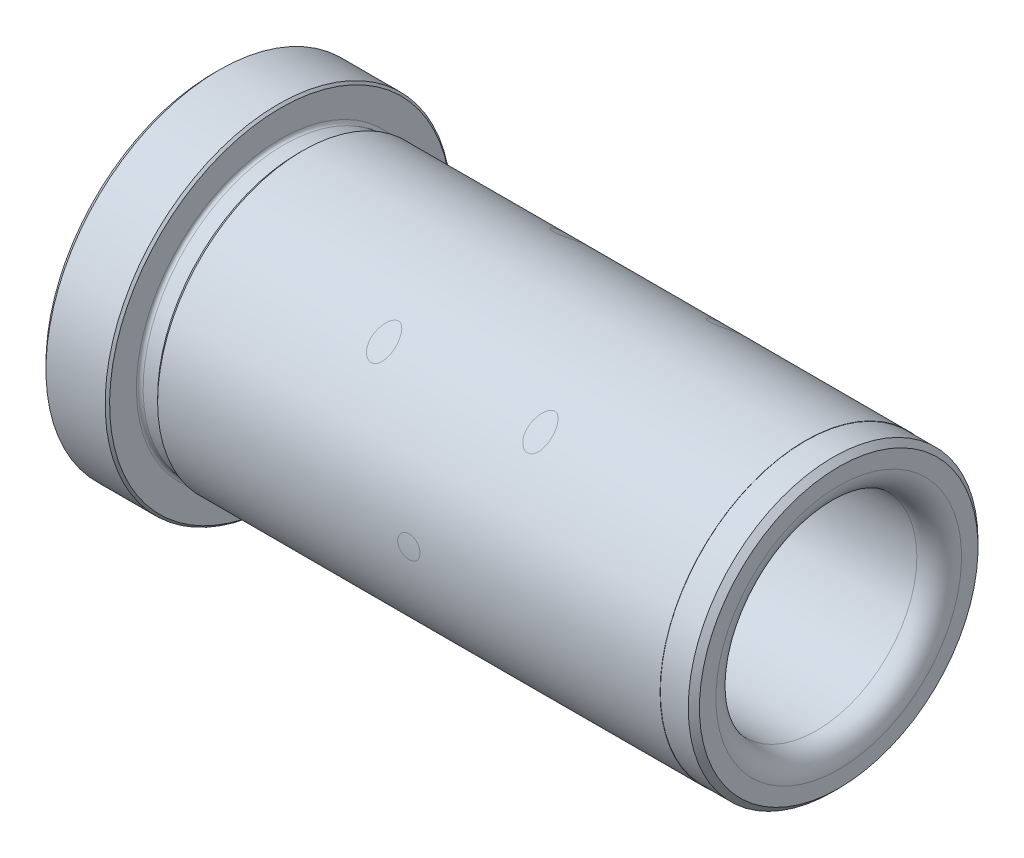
ISO-10303-21;
HEADER;
FILE_DESCRIPTION(('STEP AP214'),'2;1');
FILE_NAME('part.step','',(''),(''),'','','');
FILE_SCHEMA(('AUTOMOTIVE_DESIGN { 1 0 10303 214 1 1 1 1 }'));
ENDSEC;
DATA;
#1=APPLICATION_CONTEXT('core data for automotive mechanical design processes');
#2=APPLICATION_PROTOCOL_DEFINITION('international standard','automotive_design',2000,#1);
#3=PRODUCT_CONTEXT('',#1,'mechanical');
#4=PRODUCT('Part','Part','',(#3));
#5=PRODUCT_RELATED_PRODUCT_CATEGORY('part','',(#4));
#6=PRODUCT_DEFINITION_FORMATION('','',#4);
#7=PRODUCT_DEFINITION_CONTEXT('part definition',#1,'design');
#8=PRODUCT_DEFINITION('design','',#6,#7);
#9=PRODUCT_DEFINITION_SHAPE('','',#8);
#10=(LENGTH_UNIT() NAMED_UNIT(*) SI_UNIT(.MILLI.,.METRE.));
#11=(NAMED_UNIT(*) PLANE_ANGLE_UNIT() SI_UNIT($,.RADIAN.));
#12=(NAMED_UNIT(*) SI_UNIT($,.STERADIAN.) SOLID_ANGLE_UNIT());
#13=UNCERTAINTY_MEASURE_WITH_UNIT(LENGTH_MEASURE(1.E-05),#10,'distance_accuracy_value','');
#14=(GEOMETRIC_REPRESENTATION_CONTEXT(3) GLOBAL_UNCERTAINTY_ASSIGNED_CONTEXT((#13)) GLOBAL_UNIT_ASSIGNED_CONTEXT((#10,
#11,#12)) REPRESENTATION_CONTEXT('',''));
#15=CARTESIAN_POINT('',(0.,0.,0.));
#16=DIRECTION('',(0.,0.,1.));
#17=DIRECTION('',(1.,0.,0.));
#18=AXIS2_PLACEMENT_3D('',#15,#16,#17);
#19=CARTESIAN_POINT('',(28.,0.,0.));
#20=DIRECTION('',(1.,0.,0.));
#21=DIRECTION('',(0.,1.,0.));
#22=AXIS2_PLACEMENT_3D('',#19,#20,#21);
#23=CYLINDRICAL_SURFACE('',#22,13.);
#24=CARTESIAN_POINT('',(1.5,0.,-13.));
#25=CARTESIAN_POINT('',(1.50000245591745,-0.05608149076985,-12.9999994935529));
#26=CARTESIAN_POINT('',(1.5047335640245,-0.112201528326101,-12.9996332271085));
#27=CARTESIAN_POINT('',(1.52353782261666,-0.22288993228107,-12.9982073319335));
#28=CARTESIAN_POINT('',(1.53762165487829,-0.27745645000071,-12.9971469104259));
#29=CARTESIAN_POINT('',(1.57472261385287,-0.383418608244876,-12.9944525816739));
#30=CARTESIAN_POINT('',(1.59773480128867,-0.434815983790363,-12.9928189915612));
#31=CARTESIAN_POINT('',(1.65203067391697,-0.533005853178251,-12.9891617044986));
#32=CARTESIAN_POINT('',(1.68331254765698,-0.579799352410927,-12.9871380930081));
#33=CARTESIAN_POINT('',(1.75333419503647,-0.667568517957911,-12.9829230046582));
#34=CARTESIAN_POINT('',(1.79208833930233,-0.708532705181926,-12.9807312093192));
#35=CARTESIAN_POINT('',(1.87592424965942,-0.783382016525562,-12.9764294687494));
#36=CARTESIAN_POINT('',(1.92100628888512,-0.817266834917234,-12.9743195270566));
#37=CARTESIAN_POINT('',(2.01628664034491,-0.877033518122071,-12.9704168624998));
#38=CARTESIAN_POINT('',(2.06649120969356,-0.902905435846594,-12.968624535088));
#39=CARTESIAN_POINT('',(2.17054781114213,-0.945848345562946,-12.9655635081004));
#40=CARTESIAN_POINT('',(2.22439978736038,-0.962919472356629,-12.9642948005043));
#41=CARTESIAN_POINT('',(2.33410860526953,-0.987743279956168,-12.9624272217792));
#42=CARTESIAN_POINT('',(2.38996123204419,-0.995514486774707,-12.9618270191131));
#43=CARTESIAN_POINT('',(2.50218111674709,-1.00157507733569,-12.9613601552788));
#44=CARTESIAN_POINT('',(2.55854836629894,-0.999864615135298,-12.9614934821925));
#45=CARTESIAN_POINT('',(2.67007072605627,-0.987025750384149,-12.9624774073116));
#46=CARTESIAN_POINT('',(2.7252281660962,-0.975917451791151,-12.9633264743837));
#47=CARTESIAN_POINT('',(2.83289330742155,-0.944629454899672,-12.9656438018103));
#48=CARTESIAN_POINT('',(2.88540098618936,-0.924449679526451,-12.9671120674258));
#49=CARTESIAN_POINT('',(2.98634035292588,-0.875568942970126,-12.97050410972));
#50=CARTESIAN_POINT('',(3.0347676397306,-0.846858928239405,-12.9724283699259));
#51=CARTESIAN_POINT('',(3.1261234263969,-0.781739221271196,-12.9765151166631));
#52=CARTESIAN_POINT('',(3.16905183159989,-0.745329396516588,-12.978677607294));
#53=CARTESIAN_POINT('',(3.24830819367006,-0.665730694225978,-12.9830039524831));
#54=CARTESIAN_POINT('',(3.28461869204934,-0.622524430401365,-12.9851677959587));
#55=CARTESIAN_POINT('',(3.34947364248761,-0.530620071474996,-12.9892476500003));
#56=CARTESIAN_POINT('',(3.37801809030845,-0.481921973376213,-12.9911636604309));
#57=CARTESIAN_POINT('',(3.42652944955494,-0.380405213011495,-12.9945322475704));
#58=CARTESIAN_POINT('',(3.44649562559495,-0.327586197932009,-12.9959847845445));
#59=CARTESIAN_POINT('',(3.47727164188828,-0.219331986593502,-12.9982622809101));
#60=CARTESIAN_POINT('',(3.48808164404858,-0.163896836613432,-12.9990872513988));
#61=CARTESIAN_POINT('',(3.50021665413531,-0.0521353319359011,-13.0000152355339));
#62=CARTESIAN_POINT('',(3.50156578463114,0.00418838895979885,-13.0001200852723));
#63=CARTESIAN_POINT('',(3.49480389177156,0.116261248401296,-12.9996009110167));
#64=CARTESIAN_POINT('',(3.48669294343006,0.172010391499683,-12.9989768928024));
#65=CARTESIAN_POINT('',(3.46126111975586,0.281283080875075,-12.9970713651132));
#66=CARTESIAN_POINT('',(3.44395138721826,0.334809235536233,-12.9957906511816));
#67=CARTESIAN_POINT('',(3.40062471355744,0.438197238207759,-12.9927156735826));
#68=CARTESIAN_POINT('',(3.37460765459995,0.488059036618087,-12.9909214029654));
#69=CARTESIAN_POINT('',(3.31454397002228,0.582812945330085,-12.987016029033));
#70=CARTESIAN_POINT('',(3.28048131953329,0.627694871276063,-12.9849042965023));
#71=CARTESIAN_POINT('',(3.20531657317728,0.711112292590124,-12.9806035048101));
#72=CARTESIAN_POINT('',(3.16421437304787,0.749647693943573,-12.9784144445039));
#73=CARTESIAN_POINT('',(3.07603279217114,0.819360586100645,-12.974200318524));
#74=CARTESIAN_POINT('',(3.028940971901,0.850522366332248,-12.9721756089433));
#75=CARTESIAN_POINT('',(2.93017903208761,0.904495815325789,-12.9685242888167));
#76=CARTESIAN_POINT('',(2.87850895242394,0.927307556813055,-12.9668976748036));
#77=CARTESIAN_POINT('',(2.77211343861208,0.963906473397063,-12.9642285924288));
#78=CARTESIAN_POINT('',(2.71739136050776,0.977703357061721,-12.9631854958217));
#79=CARTESIAN_POINT('',(2.60639903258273,0.99591255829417,-12.9617993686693));
#80=CARTESIAN_POINT('',(2.55012880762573,1.00032502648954,-12.9614563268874));
#81=CARTESIAN_POINT('',(2.43779363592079,0.999638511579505,-12.9615092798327));
#82=CARTESIAN_POINT('',(2.38172853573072,0.994564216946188,-12.9619033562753));
#83=CARTESIAN_POINT('',(2.27124920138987,0.975099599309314,-12.9633820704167));
#84=CARTESIAN_POINT('',(2.21683496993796,0.96070926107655,-12.9644667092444));
#85=CARTESIAN_POINT('',(2.11119972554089,0.923027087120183,-12.967203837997));
#86=CARTESIAN_POINT('',(2.05997859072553,0.899735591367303,-12.968856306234));
#87=CARTESIAN_POINT('',(1.96216982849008,0.84491517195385,-12.9725429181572));
#88=CARTESIAN_POINT('',(1.91558211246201,0.813386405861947,-12.9745770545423));
#89=CARTESIAN_POINT('',(1.82823651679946,0.742893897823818,-12.9788040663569));
#90=CARTESIAN_POINT('',(1.78749333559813,0.703911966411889,-12.9809973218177));
#91=CARTESIAN_POINT('',(1.71311292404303,0.619650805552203,-12.9852920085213));
#92=CARTESIAN_POINT('',(1.67947742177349,0.574370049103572,-12.9873934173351));
#93=CARTESIAN_POINT('',(1.62022906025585,0.478721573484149,-12.9912708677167));
#94=CARTESIAN_POINT('',(1.59462950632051,0.428345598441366,-12.9930463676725));
#95=CARTESIAN_POINT('',(1.55228438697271,0.324031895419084,-12.9960653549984));
#96=CARTESIAN_POINT('',(1.53552857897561,0.270098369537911,-12.9973094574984));
#97=CARTESIAN_POINT('',(1.51564367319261,0.179868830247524,-12.9988038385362));
#98=CARTESIAN_POINT('',(1.50978502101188,0.144154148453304,-12.9992503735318));
#99=CARTESIAN_POINT('',(1.50196239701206,0.072298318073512,-12.9998486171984));
#100=CARTESIAN_POINT('',(1.49999841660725,0.0361571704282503,-13.0000003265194));
#101=CARTESIAN_POINT('',(1.5,0.,-13.));
#102=B_SPLINE_CURVE_WITH_KNOTS('',3,(#24,#25,#26,#27,#28,#29,#30,#31,#32,#33,#34,#35,#36,#37,
#38,#39,#40,#41,#42,#43,#44,#45,#46,#47,#48,#49,#50,#51,#52,#53,#54,#55,#56,#57,#58,#59,#60,#61,
#62,#63,#64,#65,#66,#67,#68,#69,#70,#71,#72,#73,#74,#75,#76,#77,#78,#79,#80,#81,#82,#83,#84,#85,
#86,#87,#88,#89,#90,#91,#92,#93,#94,#95,#96,#97,#98,#99,#100,#101),.UNSPECIFIED.,.T.,.F.,(4,2,2,
2,2,2,2,2,2,2,2,2,2,2,2,2,2,2,2,2,2,2,2,2,2,2,2,2,2,2,2,2,2,2,2,2,2,2,4),(0.,0.168112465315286,
0.336417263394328,0.5046290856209,0.672804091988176,0.84130581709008,1.00981481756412,
1.17853217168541,1.34724694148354,1.51562505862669,1.68400043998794,1.85201653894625,
2.02003406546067,2.18823055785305,2.35642994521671,2.5250668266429,2.69370380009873,
2.86235522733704,3.03100367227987,3.19922195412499,3.36743890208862,3.53545254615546,
3.70346846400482,3.87182189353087,4.04017781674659,4.20888928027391,4.37759927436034,
4.54612727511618,4.71465257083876,4.88273990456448,5.05082751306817,5.21890870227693,
5.38698667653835,5.55548020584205,5.7240146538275,5.89282669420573,6.06144278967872,
6.16982943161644,6.27821583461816),.UNSPECIFIED.);
#103=CARTESIAN_POINT('',(1.5,0.,-13.));
#104=VERTEX_POINT('',#103);
#105=EDGE_CURVE('E35',#104,#104,#102,.T.);
#106=ORIENTED_EDGE('',*,*,#105,.T.);
#107=EDGE_LOOP('',(#106));
#108=FACE_BOUND('',#107,.T.);
#109=CARTESIAN_POINT('',(8.5,-10.,-8.30662386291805));
#110=CARTESIAN_POINT('',(8.50000064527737,-10.0449602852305,-8.25249847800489));
#111=CARTESIAN_POINT('',(8.50302546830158,-10.089471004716,-8.19801752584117));
#112=CARTESIAN_POINT('',(8.51484631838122,-10.1773018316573,-8.08872305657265));
#113=CARTESIAN_POINT('',(8.52364236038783,-10.2206219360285,-8.03390953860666));
#114=CARTESIAN_POINT('',(8.54689596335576,-10.3058546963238,-7.92427823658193));
#115=CARTESIAN_POINT('',(8.56136039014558,-10.3477655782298,-7.86946052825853));
#116=CARTESIAN_POINT('',(8.59599474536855,-10.42983322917,-7.76036313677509));
#117=CARTESIAN_POINT('',(8.61616148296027,-10.4699909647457,-7.70608317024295));
#118=CARTESIAN_POINT('',(8.66825639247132,-10.5580705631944,-7.58512024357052));
#119=CARTESIAN_POINT('',(8.70186490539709,-10.605420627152,-7.51873259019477));
#120=CARTESIAN_POINT('',(8.7794618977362,-10.6959754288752,-7.38933657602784));
#121=CARTESIAN_POINT('',(8.8234261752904,-10.7391895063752,-7.32632075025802));
#122=CARTESIAN_POINT('',(8.9050374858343,-10.8047603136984,-7.22905372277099));
#123=CARTESIAN_POINT('',(8.93891810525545,-10.8288819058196,-7.19284480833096));
#124=CARTESIAN_POINT('',(9.01229452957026,-10.8740699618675,-7.12434347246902));
#125=CARTESIAN_POINT('',(9.05178301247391,-10.8951403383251,-7.09204604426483));
#126=CARTESIAN_POINT('',(9.12459660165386,-10.9274497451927,-7.04212030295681));
#127=CARTESIAN_POINT('',(9.15637774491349,-10.9397663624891,-7.02295668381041));
#128=CARTESIAN_POINT('',(9.22308799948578,-10.9615324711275,-6.98893503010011));
#129=CARTESIAN_POINT('',(9.25801166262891,-10.9709868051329,-6.97406972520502));
#130=CARTESIAN_POINT('',(9.32360026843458,-10.9847744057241,-6.95232808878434));
#131=CARTESIAN_POINT('',(9.35380081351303,-10.9897415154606,-6.9444672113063));
#132=CARTESIAN_POINT('',(9.41533617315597,-10.996889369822,-6.93314289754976));
#133=CARTESIAN_POINT('',(9.44666993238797,-10.9990726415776,-6.92967547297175));
#134=CARTESIAN_POINT('',(9.50965567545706,-11.0004504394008,-6.92748816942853));
#135=CARTESIAN_POINT('',(9.54130827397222,-10.9996371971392,-6.92878063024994));
#136=CARTESIAN_POINT('',(9.60386610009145,-10.9950869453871,-6.93599884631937));
#137=CARTESIAN_POINT('',(9.63477078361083,-10.9913478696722,-6.94192787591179));
#138=CARTESIAN_POINT('',(9.70113950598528,-10.9802510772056,-6.95946927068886));
#139=CARTESIAN_POINT('',(9.73626376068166,-10.9723150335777,-6.97198763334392));
#140=CARTESIAN_POINT('',(9.80363853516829,-10.9534330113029,-7.00161507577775));
#141=CARTESIAN_POINT('',(9.8358836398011,-10.9424815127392,-7.01873257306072));
#142=CARTESIAN_POINT('',(9.91307905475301,-10.9120649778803,-7.06597261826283));
#143=CARTESIAN_POINT('',(9.95609446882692,-10.8911101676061,-7.0982693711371));
#144=CARTESIAN_POINT('',(10.035844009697,-10.8455700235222,-7.16765977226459));
#145=CARTESIAN_POINT('',(10.0725624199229,-10.8209758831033,-7.20476502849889));
#146=CARTESIAN_POINT('',(10.1355774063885,-10.7728991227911,-7.27641607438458));
#147=CARTESIAN_POINT('',(10.162613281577,-10.7497683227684,-7.3105584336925));
#148=CARTESIAN_POINT('',(10.2130796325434,-10.7019441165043,-7.38039229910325));
#149=CARTESIAN_POINT('',(10.2365076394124,-10.6772496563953,-7.41608484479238));
#150=CARTESIAN_POINT('',(10.3019492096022,-10.6011429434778,-7.52486338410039));
#151=CARTESIAN_POINT('',(10.3390509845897,-10.5477629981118,-7.59956686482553));
#152=CARTESIAN_POINT('',(10.392521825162,-10.4532389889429,-7.72879332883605));
#153=CARTESIAN_POINT('',(10.4117827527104,-10.4130442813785,-7.78287557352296));
#154=CARTESIAN_POINT('',(10.4446835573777,-10.3309535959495,-7.89151602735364));
#155=CARTESIAN_POINT('',(10.4583209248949,-10.2890568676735,-7.94607443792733));
#156=CARTESIAN_POINT('',(10.4799833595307,-10.203869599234,-8.05517441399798));
#157=CARTESIAN_POINT('',(10.4880108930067,-10.160579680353,-8.10971597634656));
#158=CARTESIAN_POINT('',(10.4983194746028,-10.072854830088,-8.21842316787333));
#159=CARTESIAN_POINT('',(10.5005998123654,-10.028419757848,-8.27258874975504));
#160=CARTESIAN_POINT('',(10.4987060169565,-9.91282799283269,-8.41118313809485));
#161=CARTESIAN_POINT('',(10.4900562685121,-9.8410255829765,-8.49506819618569));
#162=CARTESIAN_POINT('',(10.4558822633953,-9.69710510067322,-8.65898233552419));
#163=CARTESIAN_POINT('',(10.4303935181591,-9.6249880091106,-8.739019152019));
#164=CARTESIAN_POINT('',(10.3711593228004,-9.50607249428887,-8.86790024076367));
#165=CARTESIAN_POINT('',(10.3426852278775,-9.45857316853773,-8.91851469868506));
#166=CARTESIAN_POINT('',(10.2756474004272,-9.36626747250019,-9.015402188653));
#167=CARTESIAN_POINT('',(10.2370966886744,-9.32145771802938,-9.06168071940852));
#168=CARTESIAN_POINT('',(10.1597131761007,-9.24705989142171,-9.13750492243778));
#169=CARTESIAN_POINT('',(10.1232153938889,-9.21641551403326,-9.16838696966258));
#170=CARTESIAN_POINT('',(10.0437579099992,-9.15933902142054,-9.22540669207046));
#171=CARTESIAN_POINT('',(10.0008070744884,-9.13290122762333,-9.2515507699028));
#172=CARTESIAN_POINT('',(9.91769418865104,-9.09045725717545,-9.2932394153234));
#173=CARTESIAN_POINT('',(9.87859960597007,-9.07342246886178,-9.30985605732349));
#174=CARTESIAN_POINT('',(9.79699884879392,-9.04414114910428,-9.33830440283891));
#175=CARTESIAN_POINT('',(9.75449455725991,-9.03189199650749,-9.35013872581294));
#176=CARTESIAN_POINT('',(9.66681877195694,-9.01298776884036,-9.36836319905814));
#177=CARTESIAN_POINT('',(9.62163236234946,-9.00636788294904,-9.37471910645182));
#178=CARTESIAN_POINT('',(9.53033876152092,-8.99941428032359,-9.38139479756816));
#179=CARTESIAN_POINT('',(9.48423197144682,-8.9990778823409,-9.38171715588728));
#180=CARTESIAN_POINT('',(9.3975108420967,-9.0044160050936,-9.37659323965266));
#181=CARTESIAN_POINT('',(9.35682029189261,-9.00947442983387,-9.37173823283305));
#182=CARTESIAN_POINT('',(9.27715047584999,-9.02430518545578,-9.35745803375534));
#183=CARTESIAN_POINT('',(9.23817130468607,-9.03407777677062,-9.34803258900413));
#184=CARTESIAN_POINT('',(9.16176345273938,-9.05806402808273,-9.32479271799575));
#185=CARTESIAN_POINT('',(9.12440430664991,-9.07238967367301,-9.31086745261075));
#186=CARTESIAN_POINT('',(9.0529492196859,-9.10463123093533,-9.27934263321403));
#187=CARTESIAN_POINT('',(9.01885486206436,-9.12254887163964,-9.26174130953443));
#188=CARTESIAN_POINT('',(8.93881704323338,-9.17044445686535,-9.21436633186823));
#189=CARTESIAN_POINT('',(8.89494643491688,-9.20210628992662,-9.18278403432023));
#190=CARTESIAN_POINT('',(8.81495715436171,-9.26960993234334,-9.11463927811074));
#191=CARTESIAN_POINT('',(8.77885710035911,-9.30546147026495,-9.07806519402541));
#192=CARTESIAN_POINT('',(8.70092020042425,-9.39479975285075,-8.98572943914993));
#193=CARTESIAN_POINT('',(8.66266236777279,-9.44955736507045,-8.92818748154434));
#194=CARTESIAN_POINT('',(8.59907770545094,-9.56127508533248,-8.8084483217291));
#195=CARTESIAN_POINT('',(8.57376282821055,-9.618237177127,-8.74624687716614));
#196=CARTESIAN_POINT('',(8.53550321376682,-9.72973936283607,-8.62199486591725));
#197=CARTESIAN_POINT('',(8.52200484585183,-9.78425867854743,-8.56009128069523));
#198=CARTESIAN_POINT('',(8.50425166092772,-9.89272951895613,-8.43450007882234));
#199=CARTESIAN_POINT('',(8.49999923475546,-9.94668089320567,-8.37081200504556));
#200=CARTESIAN_POINT('',(8.5,-10.,-8.30662386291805));
#201=B_SPLINE_CURVE_WITH_KNOTS('',3,(#109,#110,#111,#112,#113,#114,#115,#116,#117,#118,#119,
#120,#121,#122,#123,#124,#125,#126,#127,#128,#129,#130,#131,#132,#133,#134,#135,#136,#137,#138,
#139,#140,#141,#142,#143,#144,#145,#146,#147,#148,#149,#150,#151,#152,#153,#154,#155,#156,#157,
#158,#159,#160,#161,#162,#163,#164,#165,#166,#167,#168,#169,#170,#171,#172,#173,#174,#175,#176,
#177,#178,#179,#180,#181,#182,#183,#184,#185,#186,#187,#188,#189,#190,#191,#192,#193,#194,#195,
#196,#197,#198,#199,#200),.UNSPECIFIED.,.T.,.F.,(4,2,2,2,2,2,2,2,2,2,2,2,2,2,2,2,2,2,2,2,2,2,2,
2,2,2,2,2,2,2,2,2,2,2,2,2,2,2,2,2,2,2,2,2,2,4),(0.,0.21100586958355,0.422012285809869,
0.6332750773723,0.844419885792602,1.10840181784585,1.37177282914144,1.53684640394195,
1.70170639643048,1.81865510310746,1.9354048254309,2.02980705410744,2.12412352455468,
2.21868467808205,2.31331267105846,2.42705240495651,2.54100174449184,2.71322071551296,
2.88586345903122,3.03359094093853,3.1814190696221,3.47743716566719,3.68747567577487,
3.89760781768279,4.10764751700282,4.31771317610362,4.6488062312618,4.97920327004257,
5.20361578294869,5.42773973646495,5.59751848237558,5.76706605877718,5.90381939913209,
6.04049773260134,6.17802430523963,6.31549219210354,6.4387883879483,6.56209139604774,
6.6886984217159,6.81536653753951,7.00225523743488,7.18958685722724,7.45263698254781,
7.71592958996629,7.96610007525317,8.21633524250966),.UNSPECIFIED.);
#202=CARTESIAN_POINT('',(8.5,-10.,-8.30662386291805));
#203=VERTEX_POINT('',#202);
#204=EDGE_CURVE('E52',#203,#203,#201,.T.);
#205=ORIENTED_EDGE('',*,*,#204,.T.);
#206=EDGE_LOOP('',(#205));
#207=FACE_BOUND('',#206,.T.);
#208=CARTESIAN_POINT('',(-5.5,-10.,-8.30662386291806));
#209=CARTESIAN_POINT('',(-5.49999935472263,-10.0449602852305,-8.2524984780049));
#210=CARTESIAN_POINT('',(-5.49697453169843,-10.089471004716,-8.19801752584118));
#211=CARTESIAN_POINT('',(-5.48515368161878,-10.1773018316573,-8.08872305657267));
#212=CARTESIAN_POINT('',(-5.47635763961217,-10.2206219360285,-8.03390953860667));
#213=CARTESIAN_POINT('',(-5.45310403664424,-10.3058546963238,-7.92427823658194));
#214=CARTESIAN_POINT('',(-5.43863960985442,-10.3477655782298,-7.86946052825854));
#215=CARTESIAN_POINT('',(-5.40400525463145,-10.4298332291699,-7.76036313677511));
#216=CARTESIAN_POINT('',(-5.38383851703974,-10.4699909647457,-7.70608317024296));
#217=CARTESIAN_POINT('',(-5.33174360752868,-10.5580705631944,-7.58512024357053));
#218=CARTESIAN_POINT('',(-5.29813509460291,-10.605420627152,-7.51873259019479));
#219=CARTESIAN_POINT('',(-5.2205381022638,-10.6959754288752,-7.38933657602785));
#220=CARTESIAN_POINT('',(-5.1765738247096,-10.7391895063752,-7.32632075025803));
#221=CARTESIAN_POINT('',(-5.0949625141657,-10.8047603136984,-7.22905372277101));
#222=CARTESIAN_POINT('',(-5.06108189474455,-10.8288819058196,-7.19284480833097));
#223=CARTESIAN_POINT('',(-4.98770547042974,-10.8740699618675,-7.12434347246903));
#224=CARTESIAN_POINT('',(-4.94821698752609,-10.8951403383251,-7.09204604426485));
#225=CARTESIAN_POINT('',(-4.87540339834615,-10.9274497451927,-7.04212030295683));
#226=CARTESIAN_POINT('',(-4.84362225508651,-10.939766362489,-7.02295668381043));
#227=CARTESIAN_POINT('',(-4.77691200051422,-10.9615324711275,-6.98893503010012));
#228=CARTESIAN_POINT('',(-4.74198833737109,-10.9709868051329,-6.97406972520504));
#229=CARTESIAN_POINT('',(-4.67639973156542,-10.984774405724,-6.95232808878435));
#230=CARTESIAN_POINT('',(-4.64619918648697,-10.9897415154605,-6.94446721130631));
#231=CARTESIAN_POINT('',(-4.58466382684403,-10.996889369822,-6.93314289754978));
#232=CARTESIAN_POINT('',(-4.55333006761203,-10.9990726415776,-6.92967547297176));
#233=CARTESIAN_POINT('',(-4.49034432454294,-11.0004504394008,-6.92748816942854));
#234=CARTESIAN_POINT('',(-4.45869172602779,-10.9996371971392,-6.92878063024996));
#235=CARTESIAN_POINT('',(-4.39613389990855,-10.9950869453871,-6.93599884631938));
#236=CARTESIAN_POINT('',(-4.36522921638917,-10.9913478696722,-6.9419278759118));
#237=CARTESIAN_POINT('',(-4.29886049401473,-10.9802510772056,-6.95946927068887));
#238=CARTESIAN_POINT('',(-4.26373623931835,-10.9723150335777,-6.97198763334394));
#239=CARTESIAN_POINT('',(-4.19636146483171,-10.9534330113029,-7.00161507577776));
#240=CARTESIAN_POINT('',(-4.1641163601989,-10.9424815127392,-7.01873257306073));
#241=CARTESIAN_POINT('',(-4.086920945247,-10.9120649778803,-7.06597261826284));
#242=CARTESIAN_POINT('',(-4.04390553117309,-10.8911101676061,-7.0982693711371));
#243=CARTESIAN_POINT('',(-3.96415599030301,-10.8455700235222,-7.16765977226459));
#244=CARTESIAN_POINT('',(-3.92743758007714,-10.8209758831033,-7.20476502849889));
#245=CARTESIAN_POINT('',(-3.86442259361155,-10.7728991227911,-7.27641607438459));
#246=CARTESIAN_POINT('',(-3.83738671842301,-10.7497683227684,-7.3105584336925));
#247=CARTESIAN_POINT('',(-3.78692036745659,-10.7019441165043,-7.38039229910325));
#248=CARTESIAN_POINT('',(-3.76349236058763,-10.6772496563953,-7.41608484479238));
#249=CARTESIAN_POINT('',(-3.69805079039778,-10.6011429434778,-7.52486338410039));
#250=CARTESIAN_POINT('',(-3.66094901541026,-10.5477629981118,-7.59956686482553));
#251=CARTESIAN_POINT('',(-3.60747817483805,-10.4532389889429,-7.72879332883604));
#252=CARTESIAN_POINT('',(-3.58821724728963,-10.4130442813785,-7.78287557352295));
#253=CARTESIAN_POINT('',(-3.55531644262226,-10.3309535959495,-7.89151602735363));
#254=CARTESIAN_POINT('',(-3.54167907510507,-10.2890568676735,-7.94607443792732));
#255=CARTESIAN_POINT('',(-3.5200166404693,-10.203869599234,-8.05517441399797));
#256=CARTESIAN_POINT('',(-3.51198910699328,-10.160579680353,-8.10971597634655));
#257=CARTESIAN_POINT('',(-3.50168052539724,-10.0728548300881,-8.21842316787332));
#258=CARTESIAN_POINT('',(-3.49940018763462,-10.028419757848,-8.27258874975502));
#259=CARTESIAN_POINT('',(-3.50129398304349,-9.91282799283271,-8.41118313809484));
#260=CARTESIAN_POINT('',(-3.50994373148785,-9.84102558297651,-8.49506819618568));
#261=CARTESIAN_POINT('',(-3.54411773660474,-9.69710510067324,-8.65898233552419));
#262=CARTESIAN_POINT('',(-3.56960648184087,-9.62498800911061,-8.73901915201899));
#263=CARTESIAN_POINT('',(-3.62884067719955,-9.50607249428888,-8.86790024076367));
#264=CARTESIAN_POINT('',(-3.65731477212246,-9.45857316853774,-8.91851469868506));
#265=CARTESIAN_POINT('',(-3.72435259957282,-9.3662674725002,-9.015402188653));
#266=CARTESIAN_POINT('',(-3.76290331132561,-9.32145771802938,-9.06168071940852));
#267=CARTESIAN_POINT('',(-3.84028682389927,-9.24705989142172,-9.13750492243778));
#268=CARTESIAN_POINT('',(-3.87678460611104,-9.21641551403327,-9.16838696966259));
#269=CARTESIAN_POINT('',(-3.95624209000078,-9.15933902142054,-9.22540669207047));
#270=CARTESIAN_POINT('',(-3.99919292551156,-9.13290122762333,-9.2515507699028));
#271=CARTESIAN_POINT('',(-4.08230581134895,-9.09045725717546,-9.2932394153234));
#272=CARTESIAN_POINT('',(-4.12140039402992,-9.07342246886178,-9.30985605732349));
#273=CARTESIAN_POINT('',(-4.20300115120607,-9.04414114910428,-9.33830440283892));
#274=CARTESIAN_POINT('',(-4.24550544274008,-9.03189199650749,-9.35013872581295));
#275=CARTESIAN_POINT('',(-4.33318122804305,-9.01298776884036,-9.36836319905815));
#276=CARTESIAN_POINT('',(-4.37836763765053,-9.00636788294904,-9.37471910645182));
#277=CARTESIAN_POINT('',(-4.46966123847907,-8.99941428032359,-9.38139479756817));
#278=CARTESIAN_POINT('',(-4.51576802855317,-8.99907788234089,-9.38171715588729));
#279=CARTESIAN_POINT('',(-4.60248915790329,-9.00441600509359,-9.37659323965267));
#280=CARTESIAN_POINT('',(-4.64317970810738,-9.00947442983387,-9.37173823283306));
#281=CARTESIAN_POINT('',(-4.72284952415,-9.02430518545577,-9.35745803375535));
#282=CARTESIAN_POINT('',(-4.76182869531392,-9.03407777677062,-9.34803258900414));
#283=CARTESIAN_POINT('',(-4.83823654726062,-9.05806402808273,-9.32479271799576));
#284=CARTESIAN_POINT('',(-4.87559569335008,-9.072389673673,-9.31086745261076));
#285=CARTESIAN_POINT('',(-4.94705078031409,-9.10463123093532,-9.27934263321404));
#286=CARTESIAN_POINT('',(-4.98114513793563,-9.12254887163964,-9.26174130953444));
#287=CARTESIAN_POINT('',(-5.06118295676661,-9.17044445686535,-9.21436633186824));
#288=CARTESIAN_POINT('',(-5.10505356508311,-9.20210628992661,-9.18278403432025));
#289=CARTESIAN_POINT('',(-5.18504284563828,-9.26960993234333,-9.11463927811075));
#290=CARTESIAN_POINT('',(-5.22114289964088,-9.30546147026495,-9.07806519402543));
#291=CARTESIAN_POINT('',(-5.29907979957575,-9.39479975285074,-8.98572943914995));
#292=CARTESIAN_POINT('',(-5.3373376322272,-9.44955736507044,-8.92818748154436));
#293=CARTESIAN_POINT('',(-5.40092229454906,-9.56127508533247,-8.80844832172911));
#294=CARTESIAN_POINT('',(-5.42623717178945,-9.61823717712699,-8.74624687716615));
#295=CARTESIAN_POINT('',(-5.46449678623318,-9.72973936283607,-8.62199486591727));
#296=CARTESIAN_POINT('',(-5.47799515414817,-9.78425867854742,-8.56009128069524));
#297=CARTESIAN_POINT('',(-5.49574833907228,-9.89272951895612,-8.43450007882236));
#298=CARTESIAN_POINT('',(-5.50000076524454,-9.94668089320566,-8.37081200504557));
#299=CARTESIAN_POINT('',(-5.5,-10.,-8.30662386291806));
#300=B_SPLINE_CURVE_WITH_KNOTS('',3,(#208,#209,#210,#211,#212,#213,#214,#215,#216,#217,#218,
#219,#220,#221,#222,#223,#224,#225,#226,#227,#228,#229,#230,#231,#232,#233,#234,#235,#236,#237,
#238,#239,#240,#241,#242,#243,#244,#245,#246,#247,#248,#249,#250,#251,#252,#253,#254,#255,#256,
#257,#258,#259,#260,#261,#262,#263,#264,#265,#266,#267,#268,#269,#270,#271,#272,#273,#274,#275,
#276,#277,#278,#279,#280,#281,#282,#283,#284,#285,#286,#287,#288,#289,#290,#291,#292,#293,#294,
#295,#296,#297,#298,#299),.UNSPECIFIED.,.T.,.F.,(4,2,2,2,2,2,2,2,2,2,2,2,2,2,2,2,2,2,2,2,2,2,2,
2,2,2,2,2,2,2,2,2,2,2,2,2,2,2,2,2,2,2,2,2,2,4),(0.,0.211005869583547,0.422012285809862,
0.633275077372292,0.844419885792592,1.10840181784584,1.37177282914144,1.53684640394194,
1.70170639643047,1.81865510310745,1.9354048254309,2.02980705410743,2.12412352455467,
2.21868467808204,2.31331267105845,2.4270524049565,2.54100174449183,2.71322071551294,
2.88586345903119,3.03359094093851,3.18141906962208,3.47743716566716,3.68747567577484,
3.89760781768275,4.10764751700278,4.31771317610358,4.64880623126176,4.97920327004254,
5.20361578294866,5.42773973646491,5.59751848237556,5.76706605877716,5.90381939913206,
6.04049773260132,6.17802430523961,6.31549219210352,6.43878838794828,6.56209139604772,
6.68869842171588,6.81536653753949,7.00225523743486,7.18958685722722,7.45263698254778,
7.71592958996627,7.96610007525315,8.21633524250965),.UNSPECIFIED.);
#301=CARTESIAN_POINT('',(-5.5,-10.,-8.30662386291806));
#302=VERTEX_POINT('',#301);
#303=EDGE_CURVE('E99',#302,#302,#300,.T.);
#304=ORIENTED_EDGE('',*,*,#303,.T.);
#305=EDGE_LOOP('',(#304));
#306=FACE_BOUND('',#305,.T.);
#307=CARTESIAN_POINT('',(8.5,10.,-8.30662386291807));
#308=CARTESIAN_POINT('',(8.49999210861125,9.92122482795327,-8.40145629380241));
#309=CARTESIAN_POINT('',(8.50923931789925,9.84104281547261,-8.4952230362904));
#310=CARTESIAN_POINT('',(8.54889066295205,9.68027056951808,-8.67796316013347));
#311=CARTESIAN_POINT('',(8.57925665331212,9.59968133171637,-8.76694487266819));
#312=CARTESIAN_POINT('',(8.6467087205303,9.47605192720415,-8.89993733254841));
#313=CARTESIAN_POINT('',(8.67541321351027,9.431648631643,-8.94694997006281));
#314=CARTESIAN_POINT('',(8.74194748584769,9.34554604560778,-9.03684718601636));
#315=CARTESIAN_POINT('',(8.77976384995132,9.30384289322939,-9.07973770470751));
#316=CARTESIAN_POINT('',(8.8564546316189,9.23320050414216,-9.15150325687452));
#317=CARTESIAN_POINT('',(8.89352188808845,9.2033975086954,-9.18144876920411));
#318=CARTESIAN_POINT('',(8.97398089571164,9.14813348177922,-9.23651285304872));
#319=CARTESIAN_POINT('',(9.01736463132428,9.12266703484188,-9.26163744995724));
#320=CARTESIAN_POINT('',(9.1009682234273,9.08212715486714,-9.30137694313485));
#321=CARTESIAN_POINT('',(9.14015076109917,9.0659952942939,-9.31708610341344));
#322=CARTESIAN_POINT('',(9.2217163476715,9.03854000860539,-9.34372313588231));
#323=CARTESIAN_POINT('',(9.26409749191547,9.02721374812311,-9.35465382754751));
#324=CARTESIAN_POINT('',(9.3512655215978,9.01012111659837,-9.37111854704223));
#325=CARTESIAN_POINT('',(9.39606475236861,9.00438683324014,-9.37662143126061));
#326=CARTESIAN_POINT('',(9.48635987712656,8.99907214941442,-9.38172243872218));
#327=CARTESIAN_POINT('',(9.53185553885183,8.99948974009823,-9.38132248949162));
#328=CARTESIAN_POINT('',(9.61766746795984,9.00610302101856,-9.37497326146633));
#329=CARTESIAN_POINT('',(9.65806790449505,9.01175067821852,-9.3695503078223));
#330=CARTESIAN_POINT('',(9.73705026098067,9.02766735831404,-9.35421525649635));
#331=CARTESIAN_POINT('',(9.77563205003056,9.03793671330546,-9.34430283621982));
#332=CARTESIAN_POINT('',(9.85153769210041,9.06294237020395,-9.32005294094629));
#333=CARTESIAN_POINT('',(9.88876386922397,9.07782836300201,-9.30556682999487));
#334=CARTESIAN_POINT('',(9.95986506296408,9.11114183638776,-9.27295203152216));
#335=CARTESIAN_POINT('',(9.99373828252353,9.12957120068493,-9.25482140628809));
#336=CARTESIAN_POINT('',(10.07360055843,9.17894209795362,-9.20590765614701));
#337=CARTESIAN_POINT('',(10.1174060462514,9.21159302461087,-9.17327490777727));
#338=CARTESIAN_POINT('',(10.1970405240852,9.28101510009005,-9.10303338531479));
#339=CARTESIAN_POINT('',(10.2328511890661,9.31779543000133,-9.0654134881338));
#340=CARTESIAN_POINT('',(10.3100042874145,9.40940886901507,-8.97044784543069));
#341=CARTESIAN_POINT('',(10.347651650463,9.46548953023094,-8.91131207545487));
#342=CARTESIAN_POINT('',(10.4097276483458,9.57972357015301,-8.78840142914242));
#343=CARTESIAN_POINT('',(10.4341362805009,9.63787994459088,-8.7246196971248));
#344=CARTESIAN_POINT('',(10.4788722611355,9.77815242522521,-8.56754336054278));
#345=CARTESIAN_POINT('',(10.4935298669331,9.86042030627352,-8.47277010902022));
#346=CARTESIAN_POINT('',(10.5030484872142,10.0226398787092,-8.28025702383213));
#347=CARTESIAN_POINT('',(10.4978689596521,10.1025864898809,-8.18251152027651));
#348=CARTESIAN_POINT('',(10.4689265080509,10.2603458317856,-7.98384225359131));
#349=CARTESIAN_POINT('',(10.4446973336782,10.3380536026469,-7.88290058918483));
#350=CARTESIAN_POINT('',(10.393979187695,10.4499628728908,-7.73318723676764));
#351=CARTESIAN_POINT('',(10.3746969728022,10.4864652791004,-7.68360202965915));
#352=CARTESIAN_POINT('',(10.3310875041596,10.5577087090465,-7.58541041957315));
#353=CARTESIAN_POINT('',(10.3067634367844,10.5924508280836,-7.53680341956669));
#354=CARTESIAN_POINT('',(10.2514072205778,10.6613866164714,-7.43899042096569));
#355=CARTESIAN_POINT('',(10.2201188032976,10.6954822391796,-7.38985900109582));
#356=CARTESIAN_POINT('',(10.1507587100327,10.7607783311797,-7.29444834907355));
#357=CARTESIAN_POINT('',(10.1126889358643,10.791979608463,-7.24816832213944));
#358=CARTESIAN_POINT('',(10.0373534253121,10.8443319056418,-7.16953398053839));
#359=CARTESIAN_POINT('',(10.0015560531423,10.866225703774,-7.13628133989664));
#360=CARTESIAN_POINT('',(9.92433406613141,10.906548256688,-7.0745002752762));
#361=CARTESIAN_POINT('',(9.88292287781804,10.9249850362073,-7.04596092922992));
#362=CARTESIAN_POINT('',(9.80932088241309,10.9514637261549,-7.00470042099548));
#363=CARTESIAN_POINT('',(9.77880891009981,10.9609055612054,-6.98990531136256));
#364=CARTESIAN_POINT('',(9.71540018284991,10.9770720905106,-6.96448957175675));
#365=CARTESIAN_POINT('',(9.68250597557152,10.9837996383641,-6.95386455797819));
#366=CARTESIAN_POINT('',(9.61459129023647,10.9940105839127,-6.9377105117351));
#367=CARTESIAN_POINT('',(9.57955230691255,10.997459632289,-6.93223544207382));
#368=CARTESIAN_POINT('',(9.50888946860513,11.0005839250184,-6.92727680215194));
#369=CARTESIAN_POINT('',(9.47326606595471,11.0002619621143,-6.92778879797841));
#370=CARTESIAN_POINT('',(9.40766982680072,10.9961962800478,-6.93423941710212));
#371=CARTESIAN_POINT('',(9.37758824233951,10.9929246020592,-6.93942939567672));
#372=CARTESIAN_POINT('',(9.31876607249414,10.9838908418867,-6.95371938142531));
#373=CARTESIAN_POINT('',(9.29002633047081,10.9781272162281,-6.96282181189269));
#374=CARTESIAN_POINT('',(9.2226744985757,10.9616366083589,-6.9887655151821));
#375=CARTESIAN_POINT('',(9.18496210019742,10.9498419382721,-7.00725125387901));
#376=CARTESIAN_POINT('',(9.11347072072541,10.9230711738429,-7.04891010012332));
#377=CARTESIAN_POINT('',(9.07970152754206,10.9080874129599,-7.07209449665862));
#378=CARTESIAN_POINT('',(8.99642755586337,10.865875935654,-7.13687554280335));
#379=CARTESIAN_POINT('',(8.94991983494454,10.8367620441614,-7.18106501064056));
#380=CARTESIAN_POINT('',(8.86518059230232,10.7744527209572,-7.27422455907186));
#381=CARTESIAN_POINT('',(8.82697303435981,10.7412458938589,-7.32320790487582));
#382=CARTESIAN_POINT('',(8.76316831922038,10.6773311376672,-7.41601357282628));
#383=CARTESIAN_POINT('',(8.73653264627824,10.6470556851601,-7.45943067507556));
#384=CARTESIAN_POINT('',(8.68782900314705,10.5847575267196,-7.54757128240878));
#385=CARTESIAN_POINT('',(8.66576418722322,10.5527336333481,-7.59229566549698));
#386=CARTESIAN_POINT('',(8.60595046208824,10.454495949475,-7.72760459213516));
#387=CARTESIAN_POINT('',(8.57451453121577,10.3860450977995,-7.819428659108));
#388=CARTESIAN_POINT('',(8.53423632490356,10.2648242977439,-7.97748990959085));
#389=CARTESIAN_POINT('',(8.52151642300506,10.213105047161,-8.04360695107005));
#390=CARTESIAN_POINT('',(8.50439865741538,10.1078135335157,-8.17552582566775));
#391=CARTESIAN_POINT('',(8.50000543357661,10.0542402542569,-8.2413274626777));
#392=CARTESIAN_POINT('',(8.5,10.,-8.30662386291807));
#393=B_SPLINE_CURVE_WITH_KNOTS('',3,(#307,#308,#309,#310,#311,#312,#313,#314,#315,#316,#317,
#318,#319,#320,#321,#322,#323,#324,#325,#326,#327,#328,#329,#330,#331,#332,#333,#334,#335,#336,
#337,#338,#339,#340,#341,#342,#343,#344,#345,#346,#347,#348,#349,#350,#351,#352,#353,#354,#355,
#356,#357,#358,#359,#360,#361,#362,#363,#364,#365,#366,#367,#368,#369,#370,#371,#372,#373,#374,
#375,#376,#377,#378,#379,#380,#381,#382,#383,#384,#385,#386,#387,#388,#389,#390,#391,#392),
.UNSPECIFIED.,.T.,.F.,(4,2,2,2,2,2,2,2,2,2,2,2,2,2,2,2,2,2,2,2,2,2,2,2,2,2,2,2,2,2,2,2,2,2,2,2,
2,2,2,2,2,2,4),(0.,0.369587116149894,0.738508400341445,0.950177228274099,1.16153630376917,
1.3295536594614,1.49735963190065,1.63238727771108,1.76733514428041,1.90305288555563,
2.03872631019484,2.16161859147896,2.28451970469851,2.41191757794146,2.53938336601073,
2.72923093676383,2.91950929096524,3.18734763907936,3.45558955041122,3.83261776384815,
4.21041693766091,4.59776217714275,4.7911489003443,4.98441377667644,5.18653283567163,
5.38859529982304,5.54878292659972,5.70859397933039,5.81384524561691,5.91898556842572,
6.02521569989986,6.13136716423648,6.22306003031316,6.31480977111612,6.44494206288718,
6.57539079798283,6.78556798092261,6.99634414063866,7.17386180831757,7.35150157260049,
7.70635725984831,7.96069295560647,8.21517033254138),.UNSPECIFIED.);
#394=CARTESIAN_POINT('',(8.5,10.,-8.30662386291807));
#395=VERTEX_POINT('',#394);
#396=EDGE_CURVE('E86',#395,#395,#393,.T.);
#397=ORIENTED_EDGE('',*,*,#396,.T.);
#398=EDGE_LOOP('',(#397));
#399=FACE_BOUND('',#398,.T.);
#400=CARTESIAN_POINT('',(-5.5,10.,-8.30662386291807));
#401=CARTESIAN_POINT('',(-5.50000789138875,9.92122482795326,-8.40145629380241));
#402=CARTESIAN_POINT('',(-5.49076068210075,9.84104281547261,-8.4952230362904));
#403=CARTESIAN_POINT('',(-5.45110933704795,9.68027056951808,-8.67796316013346));
#404=CARTESIAN_POINT('',(-5.42074334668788,9.59968133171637,-8.76694487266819));
#405=CARTESIAN_POINT('',(-5.3532912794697,9.47605192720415,-8.8999373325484));
#406=CARTESIAN_POINT('',(-5.32458678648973,9.43164863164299,-8.94694997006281));
#407=CARTESIAN_POINT('',(-5.25805251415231,9.34554604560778,-9.03684718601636));
#408=CARTESIAN_POINT('',(-5.22023615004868,9.30384289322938,-9.0797377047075));
#409=CARTESIAN_POINT('',(-5.1435453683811,9.23320050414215,-9.15150325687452));
#410=CARTESIAN_POINT('',(-5.10647811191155,9.20339750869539,-9.18144876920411));
#411=CARTESIAN_POINT('',(-5.02601910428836,9.14813348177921,-9.23651285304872));
#412=CARTESIAN_POINT('',(-4.98263536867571,9.12266703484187,-9.26163744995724));
#413=CARTESIAN_POINT('',(-4.8990317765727,9.08212715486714,-9.30137694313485));
#414=CARTESIAN_POINT('',(-4.85984923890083,9.0659952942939,-9.31708610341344));
#415=CARTESIAN_POINT('',(-4.77828365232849,9.03854000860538,-9.34372313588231));
#416=CARTESIAN_POINT('',(-4.73590250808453,9.0272137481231,-9.3546538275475));
#417=CARTESIAN_POINT('',(-4.64873447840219,9.01012111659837,-9.37111854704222));
#418=CARTESIAN_POINT('',(-4.60393524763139,9.00438683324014,-9.37662143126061));
#419=CARTESIAN_POINT('',(-4.51364012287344,8.99907214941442,-9.38172243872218));
#420=CARTESIAN_POINT('',(-4.46814446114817,8.99948974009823,-9.38132248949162));
#421=CARTESIAN_POINT('',(-4.38233253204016,9.00610302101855,-9.37497326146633));
#422=CARTESIAN_POINT('',(-4.34193209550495,9.01175067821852,-9.36955030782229));
#423=CARTESIAN_POINT('',(-4.26294973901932,9.02766735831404,-9.35421525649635));
#424=CARTESIAN_POINT('',(-4.22436794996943,9.03793671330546,-9.34430283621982));
#425=CARTESIAN_POINT('',(-4.14846230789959,9.06294237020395,-9.32005294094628));
#426=CARTESIAN_POINT('',(-4.11123613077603,9.07782836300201,-9.30556682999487));
#427=CARTESIAN_POINT('',(-4.04013493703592,9.11114183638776,-9.27295203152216));
#428=CARTESIAN_POINT('',(-4.00626171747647,9.12957120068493,-9.25482140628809));
#429=CARTESIAN_POINT('',(-3.92639944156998,9.17894209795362,-9.20590765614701));
#430=CARTESIAN_POINT('',(-3.88259395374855,9.21159302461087,-9.17327490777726));
#431=CARTESIAN_POINT('',(-3.80295947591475,9.28101510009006,-9.10303338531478));
#432=CARTESIAN_POINT('',(-3.76714881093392,9.31779543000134,-9.06541348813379));
#433=CARTESIAN_POINT('',(-3.68999571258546,9.40940886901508,-8.97044784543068));
#434=CARTESIAN_POINT('',(-3.65234834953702,9.46548953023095,-8.91131207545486));
#435=CARTESIAN_POINT('',(-3.59027235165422,9.57972357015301,-8.7884014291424));
#436=CARTESIAN_POINT('',(-3.56586371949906,9.63787994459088,-8.72461969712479));
#437=CARTESIAN_POINT('',(-3.52112773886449,9.77815242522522,-8.56754336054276));
#438=CARTESIAN_POINT('',(-3.50647013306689,9.86042030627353,-8.4727701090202));
#439=CARTESIAN_POINT('',(-3.49695151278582,10.0226398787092,-8.28025702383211));
#440=CARTESIAN_POINT('',(-3.5021310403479,10.1025864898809,-8.18251152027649));
#441=CARTESIAN_POINT('',(-3.53107349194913,10.2603458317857,-7.98384225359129));
#442=CARTESIAN_POINT('',(-3.5553026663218,10.3380536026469,-7.88290058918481));
#443=CARTESIAN_POINT('',(-3.60602081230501,10.4499628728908,-7.73318723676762));
#444=CARTESIAN_POINT('',(-3.62530302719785,10.4864652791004,-7.68360202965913));
#445=CARTESIAN_POINT('',(-3.66891249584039,10.5577087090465,-7.58541041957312));
#446=CARTESIAN_POINT('',(-3.69323656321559,10.5924508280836,-7.53680341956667));
#447=CARTESIAN_POINT('',(-3.74859277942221,10.6613866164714,-7.43899042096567));
#448=CARTESIAN_POINT('',(-3.77988119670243,10.6954822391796,-7.3898590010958));
#449=CARTESIAN_POINT('',(-3.84924128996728,10.7607783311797,-7.29444834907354));
#450=CARTESIAN_POINT('',(-3.88731106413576,10.791979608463,-7.24816832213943));
#451=CARTESIAN_POINT('',(-3.96264657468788,10.8443319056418,-7.16953398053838));
#452=CARTESIAN_POINT('',(-3.99844394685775,10.866225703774,-7.13628133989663));
#453=CARTESIAN_POINT('',(-4.0756659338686,10.906548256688,-7.07450027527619));
#454=CARTESIAN_POINT('',(-4.11707712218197,10.9249850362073,-7.04596092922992));
#455=CARTESIAN_POINT('',(-4.19067911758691,10.9514637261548,-7.00470042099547));
#456=CARTESIAN_POINT('',(-4.22119108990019,10.9609055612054,-6.98990531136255));
#457=CARTESIAN_POINT('',(-4.2845998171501,10.9770720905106,-6.96448957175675));
#458=CARTESIAN_POINT('',(-4.31749402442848,10.9837996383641,-6.95386455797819));
#459=CARTESIAN_POINT('',(-4.38540870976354,10.9940105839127,-6.9377105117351));
#460=CARTESIAN_POINT('',(-4.42044769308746,10.997459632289,-6.93223544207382));
#461=CARTESIAN_POINT('',(-4.49111053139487,11.0005839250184,-6.92727680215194));
#462=CARTESIAN_POINT('',(-4.52673393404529,11.0002619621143,-6.92778879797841));
#463=CARTESIAN_POINT('',(-4.59233017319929,10.9961962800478,-6.93423941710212));
#464=CARTESIAN_POINT('',(-4.62241175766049,10.9929246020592,-6.93942939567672));
#465=CARTESIAN_POINT('',(-4.68123392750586,10.9838908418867,-6.95371938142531));
#466=CARTESIAN_POINT('',(-4.70997366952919,10.9781272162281,-6.96282181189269));
#467=CARTESIAN_POINT('',(-4.77732550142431,10.9616366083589,-6.9887655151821));
#468=CARTESIAN_POINT('',(-4.81503789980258,10.9498419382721,-7.00725125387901));
#469=CARTESIAN_POINT('',(-4.88652927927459,10.9230711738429,-7.04891010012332));
#470=CARTESIAN_POINT('',(-4.92029847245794,10.9080874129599,-7.07209449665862));
#471=CARTESIAN_POINT('',(-5.00357244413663,10.865875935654,-7.13687554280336));
#472=CARTESIAN_POINT('',(-5.05008016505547,10.8367620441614,-7.18106501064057));
#473=CARTESIAN_POINT('',(-5.13481940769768,10.7744527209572,-7.27422455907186));
#474=CARTESIAN_POINT('',(-5.17302696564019,10.7412458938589,-7.32320790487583));
#475=CARTESIAN_POINT('',(-5.23683168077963,10.6773311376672,-7.41601357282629));
#476=CARTESIAN_POINT('',(-5.26346735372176,10.6470556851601,-7.45943067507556));
#477=CARTESIAN_POINT('',(-5.31217099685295,10.5847575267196,-7.54757128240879));
#478=CARTESIAN_POINT('',(-5.33423581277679,10.5527336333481,-7.59229566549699));
#479=CARTESIAN_POINT('',(-5.39404953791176,10.454495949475,-7.72760459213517));
#480=CARTESIAN_POINT('',(-5.42548546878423,10.3860450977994,-7.81942865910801));
#481=CARTESIAN_POINT('',(-5.46576367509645,10.2648242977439,-7.97748990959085));
#482=CARTESIAN_POINT('',(-5.47848357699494,10.213105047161,-8.04360695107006));
#483=CARTESIAN_POINT('',(-5.49560134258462,10.1078135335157,-8.17552582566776));
#484=CARTESIAN_POINT('',(-5.49999456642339,10.0542402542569,-8.2413274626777));
#485=CARTESIAN_POINT('',(-5.5,10.,-8.30662386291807));
#486=B_SPLINE_CURVE_WITH_KNOTS('',3,(#400,#401,#402,#403,#404,#405,#406,#407,#408,#409,#410,
#411,#412,#413,#414,#415,#416,#417,#418,#419,#420,#421,#422,#423,#424,#425,#426,#427,#428,#429,
#430,#431,#432,#433,#434,#435,#436,#437,#438,#439,#440,#441,#442,#443,#444,#445,#446,#447,#448,
#449,#450,#451,#452,#453,#454,#455,#456,#457,#458,#459,#460,#461,#462,#463,#464,#465,#466,#467,
#468,#469,#470,#471,#472,#473,#474,#475,#476,#477,#478,#479,#480,#481,#482,#483,#484,#485),
.UNSPECIFIED.,.T.,.F.,(4,2,2,2,2,2,2,2,2,2,2,2,2,2,2,2,2,2,2,2,2,2,2,2,2,2,2,2,2,2,2,2,2,2,2,2,
2,2,2,2,2,2,4),(0.,0.369587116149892,0.738508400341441,0.950177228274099,1.16153630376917,
1.3295536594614,1.49735963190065,1.63238727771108,1.76733514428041,1.90305288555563,
2.03872631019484,2.16161859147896,2.28451970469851,2.41191757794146,2.53938336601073,
2.72923093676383,2.91950929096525,3.18734763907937,3.45558955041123,3.83261776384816,
4.21041693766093,4.59776217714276,4.79114890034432,4.98441377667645,5.18653283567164,
5.38859529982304,5.54878292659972,5.70859397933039,5.81384524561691,5.91898556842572,
6.02521569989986,6.13136716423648,6.22306003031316,6.31480977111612,6.44494206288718,
6.57539079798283,6.78556798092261,6.99634414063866,7.17386180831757,7.35150157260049,
7.70635725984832,7.96069295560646,8.21517033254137),.UNSPECIFIED.);
#487=CARTESIAN_POINT('',(-5.5,10.,-8.30662386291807));
#488=VERTEX_POINT('',#487);
#489=EDGE_CURVE('E92',#488,#488,#486,.T.);
#490=ORIENTED_EDGE('',*,*,#489,.T.);
#491=EDGE_LOOP('',(#490));
#492=FACE_BOUND('',#491,.T.);
#493=CARTESIAN_POINT('',(-20.,0.,0.));
#494=DIRECTION('',(1.,0.,0.));
#495=DIRECTION('',(0.,1.,0.));
#496=AXIS2_PLACEMENT_3D('',#493,#494,#495);
#497=CIRCLE('',#496,13.);
#498=CARTESIAN_POINT('',(-20.,13.,0.));
#499=VERTEX_POINT('',#498);
#500=EDGE_CURVE('E190',#499,#499,#497,.T.);
#501=ORIENTED_EDGE('',*,*,#500,.T.);
#502=EDGE_LOOP('',(#501));
#503=FACE_BOUND('',#502,.T.);
#504=CARTESIAN_POINT('',(25.,0.,0.));
#505=DIRECTION('',(1.,0.,0.));
#506=DIRECTION('',(0.,1.,0.));
#507=AXIS2_PLACEMENT_3D('',#504,#505,#506);
#508=CIRCLE('',#507,13.);
#509=CARTESIAN_POINT('',(25.,13.,0.));
#510=VERTEX_POINT('',#509);
#511=EDGE_CURVE('E193',#510,#510,#508,.T.);
#512=ORIENTED_EDGE('',*,*,#511,.F.);
#513=EDGE_LOOP('',(#512));
#514=FACE_BOUND('',#513,.T.);
#515=CARTESIAN_POINT('',(-5.5,10.,8.30662386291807));
#516=CARTESIAN_POINT('',(-5.49999935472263,10.0449602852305,8.25249847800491));
#517=CARTESIAN_POINT('',(-5.49697453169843,10.089471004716,8.19801752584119));
#518=CARTESIAN_POINT('',(-5.48515368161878,10.1773018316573,8.08872305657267));
#519=CARTESIAN_POINT('',(-5.47635763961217,10.2206219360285,8.03390953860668));
#520=CARTESIAN_POINT('',(-5.45310403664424,10.3058546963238,7.92427823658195));
#521=CARTESIAN_POINT('',(-5.43863960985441,10.3477655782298,7.86946052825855));
#522=CARTESIAN_POINT('',(-5.40400525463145,10.4298332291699,7.76036313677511));
#523=CARTESIAN_POINT('',(-5.38383851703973,10.4699909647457,7.70608317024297));
#524=CARTESIAN_POINT('',(-5.33174360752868,10.5580705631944,7.58512024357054));
#525=CARTESIAN_POINT('',(-5.29813509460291,10.605420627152,7.51873259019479));
#526=CARTESIAN_POINT('',(-5.22053810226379,10.6959754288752,7.38933657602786));
#527=CARTESIAN_POINT('',(-5.1765738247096,10.7391895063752,7.32632075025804));
#528=CARTESIAN_POINT('',(-5.0949625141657,10.8047603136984,7.22905372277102));
#529=CARTESIAN_POINT('',(-5.06108189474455,10.8288819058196,7.19284480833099));
#530=CARTESIAN_POINT('',(-4.98770547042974,10.8740699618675,7.12434347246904));
#531=CARTESIAN_POINT('',(-4.94821698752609,10.8951403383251,7.09204604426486));
#532=CARTESIAN_POINT('',(-4.87540339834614,10.9274497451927,7.04212030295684));
#533=CARTESIAN_POINT('',(-4.84362225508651,10.939766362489,7.02295668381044));
#534=CARTESIAN_POINT('',(-4.77691200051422,10.9615324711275,6.98893503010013));
#535=CARTESIAN_POINT('',(-4.74198833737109,10.9709868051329,6.97406972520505));
#536=CARTESIAN_POINT('',(-4.67639973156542,10.984774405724,6.95232808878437));
#537=CARTESIAN_POINT('',(-4.64619918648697,10.9897415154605,6.94446721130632));
#538=CARTESIAN_POINT('',(-4.58466382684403,10.996889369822,6.93314289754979));
#539=CARTESIAN_POINT('',(-4.55333006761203,10.9990726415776,6.92967547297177));
#540=CARTESIAN_POINT('',(-4.49034432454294,11.0004504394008,6.92748816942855));
#541=CARTESIAN_POINT('',(-4.45869172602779,10.9996371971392,6.92878063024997));
#542=CARTESIAN_POINT('',(-4.39613389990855,10.9950869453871,6.93599884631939));
#543=CARTESIAN_POINT('',(-4.36522921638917,10.9913478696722,6.94192787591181));
#544=CARTESIAN_POINT('',(-4.29886049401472,10.9802510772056,6.95946927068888));
#545=CARTESIAN_POINT('',(-4.26373623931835,10.9723150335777,6.97198763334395));
#546=CARTESIAN_POINT('',(-4.19636146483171,10.9534330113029,7.00161507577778));
#547=CARTESIAN_POINT('',(-4.1641163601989,10.9424815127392,7.01873257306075));
#548=CARTESIAN_POINT('',(-4.08692094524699,10.9120649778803,7.06597261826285));
#549=CARTESIAN_POINT('',(-4.04390553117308,10.8911101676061,7.09826937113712));
#550=CARTESIAN_POINT('',(-3.964155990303,10.8455700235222,7.16765977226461));
#551=CARTESIAN_POINT('',(-3.92743758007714,10.8209758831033,7.20476502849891));
#552=CARTESIAN_POINT('',(-3.86442259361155,10.7728991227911,7.27641607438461));
#553=CARTESIAN_POINT('',(-3.83738671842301,10.7497683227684,7.31055843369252));
#554=CARTESIAN_POINT('',(-3.78692036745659,10.7019441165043,7.38039229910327));
#555=CARTESIAN_POINT('',(-3.76349236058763,10.6772496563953,7.4160848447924));
#556=CARTESIAN_POINT('',(-3.69805079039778,10.6011429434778,7.5248633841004));
#557=CARTESIAN_POINT('',(-3.66094901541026,10.5477629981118,7.59956686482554));
#558=CARTESIAN_POINT('',(-3.60747817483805,10.4532389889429,7.72879332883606));
#559=CARTESIAN_POINT('',(-3.58821724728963,10.4130442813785,7.78287557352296));
#560=CARTESIAN_POINT('',(-3.55531644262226,10.3309535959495,7.89151602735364));
#561=CARTESIAN_POINT('',(-3.54167907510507,10.2890568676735,7.94607443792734));
#562=CARTESIAN_POINT('',(-3.5200166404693,10.203869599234,8.05517441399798));
#563=CARTESIAN_POINT('',(-3.51198910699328,10.160579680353,8.10971597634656));
#564=CARTESIAN_POINT('',(-3.50168052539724,10.072854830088,8.21842316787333));
#565=CARTESIAN_POINT('',(-3.49940018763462,10.028419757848,8.27258874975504));
#566=CARTESIAN_POINT('',(-3.50129398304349,9.9128279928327,8.41118313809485));
#567=CARTESIAN_POINT('',(-3.50994373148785,9.8410255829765,8.4950681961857));
#568=CARTESIAN_POINT('',(-3.54411773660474,9.69710510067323,8.6589823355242));
#569=CARTESIAN_POINT('',(-3.56960648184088,9.6249880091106,8.73901915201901));
#570=CARTESIAN_POINT('',(-3.62884067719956,9.50607249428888,8.86790024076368));
#571=CARTESIAN_POINT('',(-3.65731477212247,9.45857316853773,8.91851469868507));
#572=CARTESIAN_POINT('',(-3.72435259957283,9.36626747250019,9.01540218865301));
#573=CARTESIAN_POINT('',(-3.76290331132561,9.32145771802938,9.06168071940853));
#574=CARTESIAN_POINT('',(-3.84028682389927,9.24705989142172,9.13750492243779));
#575=CARTESIAN_POINT('',(-3.87678460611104,9.21641551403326,9.1683869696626));
#576=CARTESIAN_POINT('',(-3.95624209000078,9.15933902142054,9.22540669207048));
#577=CARTESIAN_POINT('',(-3.99919292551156,9.13290122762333,9.25155076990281));
#578=CARTESIAN_POINT('',(-4.08230581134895,9.09045725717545,9.29323941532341));
#579=CARTESIAN_POINT('',(-4.12140039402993,9.07342246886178,9.3098560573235));
#580=CARTESIAN_POINT('',(-4.20300115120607,9.04414114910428,9.33830440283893));
#581=CARTESIAN_POINT('',(-4.24550544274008,9.03189199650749,9.35013872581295));
#582=CARTESIAN_POINT('',(-4.33318122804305,9.01298776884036,9.36836319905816));
#583=CARTESIAN_POINT('',(-4.37836763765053,9.00636788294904,9.37471910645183));
#584=CARTESIAN_POINT('',(-4.46966123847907,8.99941428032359,9.38139479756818));
#585=CARTESIAN_POINT('',(-4.51576802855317,8.99907788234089,9.38171715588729));
#586=CARTESIAN_POINT('',(-4.6024891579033,9.00441600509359,9.37659323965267));
#587=CARTESIAN_POINT('',(-4.64317970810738,9.00947442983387,9.37173823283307));
#588=CARTESIAN_POINT('',(-4.72284952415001,9.02430518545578,9.35745803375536));
#589=CARTESIAN_POINT('',(-4.76182869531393,9.03407777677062,9.34803258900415));
#590=CARTESIAN_POINT('',(-4.83823654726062,9.05806402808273,9.32479271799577));
#591=CARTESIAN_POINT('',(-4.87559569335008,9.07238967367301,9.31086745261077));
#592=CARTESIAN_POINT('',(-4.94705078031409,9.10463123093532,9.27934263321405));
#593=CARTESIAN_POINT('',(-4.98114513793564,9.12254887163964,9.26174130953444));
#594=CARTESIAN_POINT('',(-5.06118295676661,9.17044445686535,9.21436633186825));
#595=CARTESIAN_POINT('',(-5.10505356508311,9.20210628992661,9.18278403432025));
#596=CARTESIAN_POINT('',(-5.18504284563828,9.26960993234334,9.11463927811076));
#597=CARTESIAN_POINT('',(-5.22114289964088,9.30546147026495,9.07806519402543));
#598=CARTESIAN_POINT('',(-5.29907979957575,9.39479975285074,8.98572943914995));
#599=CARTESIAN_POINT('',(-5.3373376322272,9.44955736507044,8.92818748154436));
#600=CARTESIAN_POINT('',(-5.40092229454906,9.56127508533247,8.80844832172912));
#601=CARTESIAN_POINT('',(-5.42623717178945,9.61823717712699,8.74624687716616));
#602=CARTESIAN_POINT('',(-5.46449678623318,9.72973936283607,8.62199486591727));
#603=CARTESIAN_POINT('',(-5.47799515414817,9.78425867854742,8.56009128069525));
#604=CARTESIAN_POINT('',(-5.49574833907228,9.89272951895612,8.43450007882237));
#605=CARTESIAN_POINT('',(-5.50000076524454,9.94668089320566,8.37081200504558));
#606=CARTESIAN_POINT('',(-5.5,10.,8.30662386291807));
#607=B_SPLINE_CURVE_WITH_KNOTS('',3,(#515,#516,#517,#518,#519,#520,#521,#522,#523,#524,#525,
#526,#527,#528,#529,#530,#531,#532,#533,#534,#535,#536,#537,#538,#539,#540,#541,#542,#543,#544,
#545,#546,#547,#548,#549,#550,#551,#552,#553,#554,#555,#556,#557,#558,#559,#560,#561,#562,#563,
#564,#565,#566,#567,#568,#569,#570,#571,#572,#573,#574,#575,#576,#577,#578,#579,#580,#581,#582,
#583,#584,#585,#586,#587,#588,#589,#590,#591,#592,#593,#594,#595,#596,#597,#598,#599,#600,#601,
#602,#603,#604,#605,#606),.UNSPECIFIED.,.T.,.F.,(4,2,2,2,2,2,2,2,2,2,2,2,2,2,2,2,2,2,2,2,2,2,2,
2,2,2,2,2,2,2,2,2,2,2,2,2,2,2,2,2,2,2,2,2,2,4),(0.,0.211005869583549,0.422012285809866,
0.633275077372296,0.844419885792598,1.10840181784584,1.37177282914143,1.53684640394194,
1.70170639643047,1.81865510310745,1.9354048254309,2.02980705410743,2.12412352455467,
2.21868467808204,2.31331267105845,2.4270524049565,2.54100174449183,2.71322071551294,
2.8858634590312,3.03359094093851,3.18141906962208,3.47743716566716,3.68747567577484,
3.89760781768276,4.10764751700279,4.31771317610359,4.64880623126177,4.97920327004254,
5.20361578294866,5.42773973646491,5.59751848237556,5.76706605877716,5.90381939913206,
6.04049773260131,6.1780243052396,6.31549219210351,6.43878838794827,6.56209139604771,
6.68869842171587,6.81536653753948,7.00225523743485,7.18958685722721,7.45263698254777,
7.71592958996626,7.96610007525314,8.21633524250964),.UNSPECIFIED.);
#608=CARTESIAN_POINT('',(-5.5,10.,8.30662386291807));
#609=VERTEX_POINT('',#608);
#610=EDGE_CURVE('E69',#609,#609,#607,.T.);
#611=ORIENTED_EDGE('',*,*,#610,.T.);
#612=EDGE_LOOP('',(#611));
#613=FACE_BOUND('',#612,.T.);
#614=CARTESIAN_POINT('',(8.5,10.,8.30662386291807));
#615=CARTESIAN_POINT('',(8.50000064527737,10.0449602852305,8.25249847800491));
#616=CARTESIAN_POINT('',(8.50302546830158,10.089471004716,8.19801752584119));
#617=CARTESIAN_POINT('',(8.51484631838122,10.1773018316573,8.08872305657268));
#618=CARTESIAN_POINT('',(8.52364236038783,10.2206219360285,8.03390953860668));
#619=CARTESIAN_POINT('',(8.54689596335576,10.3058546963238,7.92427823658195));
#620=CARTESIAN_POINT('',(8.56136039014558,10.3477655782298,7.86946052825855));
#621=CARTESIAN_POINT('',(8.59599474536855,10.42983322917,7.76036313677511));
#622=CARTESIAN_POINT('',(8.61616148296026,10.4699909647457,7.70608317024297));
#623=CARTESIAN_POINT('',(8.66825639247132,10.5580705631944,7.58512024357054));
#624=CARTESIAN_POINT('',(8.70186490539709,10.605420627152,7.5187325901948));
#625=CARTESIAN_POINT('',(8.7794618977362,10.6959754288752,7.38933657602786));
#626=CARTESIAN_POINT('',(8.8234261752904,10.7391895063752,7.32632075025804));
#627=CARTESIAN_POINT('',(8.9050374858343,10.8047603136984,7.22905372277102));
#628=CARTESIAN_POINT('',(8.93891810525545,10.8288819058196,7.19284480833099));
#629=CARTESIAN_POINT('',(9.01229452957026,10.8740699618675,7.12434347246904));
#630=CARTESIAN_POINT('',(9.05178301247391,10.8951403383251,7.09204604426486));
#631=CARTESIAN_POINT('',(9.12459660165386,10.9274497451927,7.04212030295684));
#632=CARTESIAN_POINT('',(9.15637774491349,10.9397663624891,7.02295668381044));
#633=CARTESIAN_POINT('',(9.22308799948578,10.9615324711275,6.98893503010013));
#634=CARTESIAN_POINT('',(9.25801166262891,10.9709868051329,6.97406972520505));
#635=CARTESIAN_POINT('',(9.32360026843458,10.9847744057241,6.95232808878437));
#636=CARTESIAN_POINT('',(9.35380081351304,10.9897415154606,6.94446721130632));
#637=CARTESIAN_POINT('',(9.41533617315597,10.996889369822,6.93314289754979));
#638=CARTESIAN_POINT('',(9.44666993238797,10.9990726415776,6.92967547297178));
#639=CARTESIAN_POINT('',(9.50965567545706,11.0004504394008,6.92748816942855));
#640=CARTESIAN_POINT('',(9.54130827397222,10.9996371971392,6.92878063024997));
#641=CARTESIAN_POINT('',(9.60386610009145,10.9950869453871,6.93599884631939));
#642=CARTESIAN_POINT('',(9.63477078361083,10.9913478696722,6.94192787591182));
#643=CARTESIAN_POINT('',(9.70113950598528,10.9802510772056,6.95946927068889));
#644=CARTESIAN_POINT('',(9.73626376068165,10.9723150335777,6.97198763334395));
#645=CARTESIAN_POINT('',(9.80363853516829,10.9534330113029,7.00161507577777));
#646=CARTESIAN_POINT('',(9.8358836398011,10.9424815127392,7.01873257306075));
#647=CARTESIAN_POINT('',(9.91307905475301,10.9120649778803,7.06597261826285));
#648=CARTESIAN_POINT('',(9.95609446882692,10.8911101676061,7.09826937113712));
#649=CARTESIAN_POINT('',(10.035844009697,10.8455700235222,7.16765977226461));
#650=CARTESIAN_POINT('',(10.0725624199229,10.8209758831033,7.20476502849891));
#651=CARTESIAN_POINT('',(10.1355774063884,10.7728991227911,7.27641607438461));
#652=CARTESIAN_POINT('',(10.162613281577,10.7497683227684,7.31055843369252));
#653=CARTESIAN_POINT('',(10.2130796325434,10.7019441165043,7.38039229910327));
#654=CARTESIAN_POINT('',(10.2365076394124,10.6772496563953,7.4160848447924));
#655=CARTESIAN_POINT('',(10.3019492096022,10.6011429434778,7.52486338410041));
#656=CARTESIAN_POINT('',(10.3390509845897,10.5477629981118,7.59956686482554));
#657=CARTESIAN_POINT('',(10.392521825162,10.4532389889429,7.72879332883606));
#658=CARTESIAN_POINT('',(10.4117827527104,10.4130442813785,7.78287557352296));
#659=CARTESIAN_POINT('',(10.4446835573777,10.3309535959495,7.89151602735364));
#660=CARTESIAN_POINT('',(10.4583209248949,10.2890568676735,7.94607443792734));
#661=CARTESIAN_POINT('',(10.4799833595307,10.203869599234,8.05517441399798));
#662=CARTESIAN_POINT('',(10.4880108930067,10.160579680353,8.10971597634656));
#663=CARTESIAN_POINT('',(10.4983194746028,10.072854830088,8.21842316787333));
#664=CARTESIAN_POINT('',(10.5005998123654,10.028419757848,8.27258874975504));
#665=CARTESIAN_POINT('',(10.4987060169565,9.9128279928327,8.41118313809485));
#666=CARTESIAN_POINT('',(10.4900562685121,9.84102558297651,8.4950681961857));
#667=CARTESIAN_POINT('',(10.4558822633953,9.69710510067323,8.6589823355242));
#668=CARTESIAN_POINT('',(10.4303935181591,9.62498800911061,8.73901915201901));
#669=CARTESIAN_POINT('',(10.3711593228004,9.50607249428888,8.86790024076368));
#670=CARTESIAN_POINT('',(10.3426852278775,9.45857316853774,8.91851469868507));
#671=CARTESIAN_POINT('',(10.2756474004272,9.3662674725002,9.01540218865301));
#672=CARTESIAN_POINT('',(10.2370966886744,9.32145771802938,9.06168071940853));
#673=CARTESIAN_POINT('',(10.1597131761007,9.24705989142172,9.1375049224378));
#674=CARTESIAN_POINT('',(10.123215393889,9.21641551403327,9.1683869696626));
#675=CARTESIAN_POINT('',(10.0437579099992,9.15933902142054,9.22540669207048));
#676=CARTESIAN_POINT('',(10.0008070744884,9.13290122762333,9.25155076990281));
#677=CARTESIAN_POINT('',(9.91769418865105,9.09045725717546,9.29323941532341));
#678=CARTESIAN_POINT('',(9.87859960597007,9.07342246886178,9.3098560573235));
#679=CARTESIAN_POINT('',(9.79699884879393,9.04414114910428,9.33830440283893));
#680=CARTESIAN_POINT('',(9.75449455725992,9.03189199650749,9.35013872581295));
#681=CARTESIAN_POINT('',(9.66681877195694,9.01298776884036,9.36836319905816));
#682=CARTESIAN_POINT('',(9.62163236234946,9.00636788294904,9.37471910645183));
#683=CARTESIAN_POINT('',(9.53033876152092,8.99941428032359,9.38139479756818));
#684=CARTESIAN_POINT('',(9.48423197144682,8.9990778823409,9.3817171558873));
#685=CARTESIAN_POINT('',(9.3975108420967,9.0044160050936,9.37659323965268));
#686=CARTESIAN_POINT('',(9.35682029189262,9.00947442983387,9.37173823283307));
#687=CARTESIAN_POINT('',(9.27715047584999,9.02430518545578,9.35745803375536));
#688=CARTESIAN_POINT('',(9.23817130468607,9.03407777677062,9.34803258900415));
#689=CARTESIAN_POINT('',(9.16176345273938,9.05806402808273,9.32479271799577));
#690=CARTESIAN_POINT('',(9.12440430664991,9.07238967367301,9.31086745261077));
#691=CARTESIAN_POINT('',(9.0529492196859,9.10463123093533,9.27934263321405));
#692=CARTESIAN_POINT('',(9.01885486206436,9.12254887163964,9.26174130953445));
#693=CARTESIAN_POINT('',(8.93881704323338,9.17044445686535,9.21436633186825));
#694=CARTESIAN_POINT('',(8.89494643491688,9.20210628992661,9.18278403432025));
#695=CARTESIAN_POINT('',(8.81495715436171,9.26960993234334,9.11463927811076));
#696=CARTESIAN_POINT('',(8.77885710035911,9.30546147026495,9.07806519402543));
#697=CARTESIAN_POINT('',(8.70092020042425,9.39479975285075,8.98572943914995));
#698=CARTESIAN_POINT('',(8.66266236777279,9.44955736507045,8.92818748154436));
#699=CARTESIAN_POINT('',(8.59907770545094,9.56127508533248,8.80844832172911));
#700=CARTESIAN_POINT('',(8.57376282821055,9.61823717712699,8.74624687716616));
#701=CARTESIAN_POINT('',(8.53550321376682,9.72973936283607,8.62199486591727));
#702=CARTESIAN_POINT('',(8.52200484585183,9.78425867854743,8.56009128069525));
#703=CARTESIAN_POINT('',(8.50425166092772,9.89272951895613,8.43450007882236));
#704=CARTESIAN_POINT('',(8.49999923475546,9.94668089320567,8.37081200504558));
#705=CARTESIAN_POINT('',(8.5,10.,8.30662386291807));
#706=B_SPLINE_CURVE_WITH_KNOTS('',3,(#614,#615,#616,#617,#618,#619,#620,#621,#622,#623,#624,
#625,#626,#627,#628,#629,#630,#631,#632,#633,#634,#635,#636,#637,#638,#639,#640,#641,#642,#643,
#644,#645,#646,#647,#648,#649,#650,#651,#652,#653,#654,#655,#656,#657,#658,#659,#660,#661,#662,
#663,#664,#665,#666,#667,#668,#669,#670,#671,#672,#673,#674,#675,#676,#677,#678,#679,#680,#681,
#682,#683,#684,#685,#686,#687,#688,#689,#690,#691,#692,#693,#694,#695,#696,#697,#698,#699,#700,
#701,#702,#703,#704,#705),.UNSPECIFIED.,.T.,.F.,(4,2,2,2,2,2,2,2,2,2,2,2,2,2,2,2,2,2,2,2,2,2,2,
2,2,2,2,2,2,2,2,2,2,2,2,2,2,2,2,2,2,2,2,2,2,4),(0.,0.211005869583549,0.422012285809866,
0.633275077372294,0.844419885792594,1.10840181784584,1.37177282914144,1.53684640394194,
1.70170639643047,1.81865510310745,1.9354048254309,2.02980705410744,2.12412352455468,
2.21868467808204,2.31331267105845,2.4270524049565,2.54100174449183,2.71322071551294,
2.8858634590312,3.03359094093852,3.18141906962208,3.47743716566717,3.68747567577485,
3.89760781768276,4.10764751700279,4.31771317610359,4.64880623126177,4.97920327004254,
5.20361578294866,5.42773973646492,5.59751848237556,5.76706605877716,5.90381939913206,
6.04049773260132,6.17802430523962,6.31549219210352,6.43878838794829,6.56209139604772,
6.68869842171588,6.81536653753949,7.00225523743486,7.18958685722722,7.45263698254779,
7.71592958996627,7.96610007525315,8.21633524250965),.UNSPECIFIED.);
#707=CARTESIAN_POINT('',(8.5,10.,8.30662386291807));
#708=VERTEX_POINT('',#707);
#709=EDGE_CURVE('E96',#708,#708,#706,.T.);
#710=ORIENTED_EDGE('',*,*,#709,.T.);
#711=EDGE_LOOP('',(#710));
#712=FACE_BOUND('',#711,.T.);
#713=CARTESIAN_POINT('',(-5.5,-10.,8.30662386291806));
#714=CARTESIAN_POINT('',(-5.50000789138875,-9.92122482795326,8.4014562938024));
#715=CARTESIAN_POINT('',(-5.49076068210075,-9.84104281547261,8.49522303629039));
#716=CARTESIAN_POINT('',(-5.45110933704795,-9.68027056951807,8.67796316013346));
#717=CARTESIAN_POINT('',(-5.42074334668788,-9.59968133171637,8.76694487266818));
#718=CARTESIAN_POINT('',(-5.3532912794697,-9.47605192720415,8.8999373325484));
#719=CARTESIAN_POINT('',(-5.32458678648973,-9.43164863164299,8.9469499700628));
#720=CARTESIAN_POINT('',(-5.25805251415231,-9.34554604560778,9.03684718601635));
#721=CARTESIAN_POINT('',(-5.22023615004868,-9.30384289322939,9.0797377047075));
#722=CARTESIAN_POINT('',(-5.1435453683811,-9.23320050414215,9.15150325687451));
#723=CARTESIAN_POINT('',(-5.10647811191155,-9.20339750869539,9.1814487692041));
#724=CARTESIAN_POINT('',(-5.02601910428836,-9.14813348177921,9.23651285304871));
#725=CARTESIAN_POINT('',(-4.98263536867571,-9.12266703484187,9.26163744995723));
#726=CARTESIAN_POINT('',(-4.8990317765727,-9.08212715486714,9.30137694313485));
#727=CARTESIAN_POINT('',(-4.85984923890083,-9.0659952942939,9.31708610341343));
#728=CARTESIAN_POINT('',(-4.7782836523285,-9.03854000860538,9.3437231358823));
#729=CARTESIAN_POINT('',(-4.73590250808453,-9.0272137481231,9.3546538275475));
#730=CARTESIAN_POINT('',(-4.6487344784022,-9.01012111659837,9.37111854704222));
#731=CARTESIAN_POINT('',(-4.60393524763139,-9.00438683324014,9.37662143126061));
#732=CARTESIAN_POINT('',(-4.51364012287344,-8.99907214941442,9.38172243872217));
#733=CARTESIAN_POINT('',(-4.46814446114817,-8.99948974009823,9.38132248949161));
#734=CARTESIAN_POINT('',(-4.38233253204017,-9.00610302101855,9.37497326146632));
#735=CARTESIAN_POINT('',(-4.34193209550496,-9.01175067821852,9.36955030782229));
#736=CARTESIAN_POINT('',(-4.26294973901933,-9.02766735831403,9.35421525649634));
#737=CARTESIAN_POINT('',(-4.22436794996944,-9.03793671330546,9.34430283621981));
#738=CARTESIAN_POINT('',(-4.14846230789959,-9.06294237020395,9.32005294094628));
#739=CARTESIAN_POINT('',(-4.11123613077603,-9.07782836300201,9.30556682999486));
#740=CARTESIAN_POINT('',(-4.04013493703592,-9.11114183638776,9.27295203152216));
#741=CARTESIAN_POINT('',(-4.00626171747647,-9.12957120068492,9.25482140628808));
#742=CARTESIAN_POINT('',(-3.92639944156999,-9.17894209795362,9.205907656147));
#743=CARTESIAN_POINT('',(-3.88259395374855,-9.21159302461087,9.17327490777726));
#744=CARTESIAN_POINT('',(-3.80295947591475,-9.28101510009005,9.10303338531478));
#745=CARTESIAN_POINT('',(-3.76714881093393,-9.31779543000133,9.06541348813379));
#746=CARTESIAN_POINT('',(-3.68999571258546,-9.40940886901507,8.97044784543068));
#747=CARTESIAN_POINT('',(-3.65234834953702,-9.46548953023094,8.91131207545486));
#748=CARTESIAN_POINT('',(-3.59027235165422,-9.579723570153,8.7884014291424));
#749=CARTESIAN_POINT('',(-3.56586371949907,-9.63787994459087,8.72461969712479));
#750=CARTESIAN_POINT('',(-3.5211277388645,-9.77815242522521,8.56754336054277));
#751=CARTESIAN_POINT('',(-3.50647013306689,-9.86042030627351,8.47277010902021));
#752=CARTESIAN_POINT('',(-3.49695151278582,-10.0226398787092,8.28025702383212));
#753=CARTESIAN_POINT('',(-3.5021310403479,-10.1025864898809,8.1825115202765));
#754=CARTESIAN_POINT('',(-3.53107349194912,-10.2603458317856,7.98384225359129));
#755=CARTESIAN_POINT('',(-3.55530266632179,-10.3380536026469,7.88290058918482));
#756=CARTESIAN_POINT('',(-3.60602081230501,-10.4499628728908,7.73318723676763));
#757=CARTESIAN_POINT('',(-3.62530302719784,-10.4864652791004,7.68360202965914));
#758=CARTESIAN_POINT('',(-3.66891249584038,-10.5577087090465,7.58541041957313));
#759=CARTESIAN_POINT('',(-3.69323656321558,-10.5924508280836,7.53680341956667));
#760=CARTESIAN_POINT('',(-3.7485927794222,-10.6613866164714,7.43899042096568));
#761=CARTESIAN_POINT('',(-3.77988119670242,-10.6954822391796,7.38985900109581));
#762=CARTESIAN_POINT('',(-3.84924128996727,-10.7607783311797,7.29444834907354));
#763=CARTESIAN_POINT('',(-3.88731106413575,-10.791979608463,7.24816832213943));
#764=CARTESIAN_POINT('',(-3.96264657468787,-10.8443319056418,7.16953398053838));
#765=CARTESIAN_POINT('',(-3.99844394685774,-10.866225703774,7.13628133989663));
#766=CARTESIAN_POINT('',(-4.07566593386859,-10.906548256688,7.07450027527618));
#767=CARTESIAN_POINT('',(-4.11707712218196,-10.9249850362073,7.04596092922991));
#768=CARTESIAN_POINT('',(-4.19067911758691,-10.9514637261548,7.00470042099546));
#769=CARTESIAN_POINT('',(-4.22119108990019,-10.9609055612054,6.98990531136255));
#770=CARTESIAN_POINT('',(-4.28459981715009,-10.9770720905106,6.96448957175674));
#771=CARTESIAN_POINT('',(-4.31749402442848,-10.9837996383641,6.95386455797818));
#772=CARTESIAN_POINT('',(-4.38540870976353,-10.9940105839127,6.93771051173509));
#773=CARTESIAN_POINT('',(-4.42044769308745,-10.997459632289,6.93223544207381));
#774=CARTESIAN_POINT('',(-4.49111053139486,-11.0005839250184,6.92727680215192));
#775=CARTESIAN_POINT('',(-4.52673393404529,-11.0002619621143,6.92778879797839));
#776=CARTESIAN_POINT('',(-4.59233017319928,-10.9961962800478,6.93423941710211));
#777=CARTESIAN_POINT('',(-4.62241175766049,-10.9929246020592,6.9394293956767));
#778=CARTESIAN_POINT('',(-4.68123392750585,-10.9838908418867,6.9537193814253));
#779=CARTESIAN_POINT('',(-4.70997366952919,-10.9781272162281,6.96282181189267));
#780=CARTESIAN_POINT('',(-4.7773255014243,-10.9616366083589,6.98876551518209));
#781=CARTESIAN_POINT('',(-4.81503789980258,-10.9498419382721,7.00725125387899));
#782=CARTESIAN_POINT('',(-4.88652927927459,-10.9230711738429,7.0489101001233));
#783=CARTESIAN_POINT('',(-4.92029847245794,-10.9080874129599,7.07209449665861));
#784=CARTESIAN_POINT('',(-5.00357244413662,-10.865875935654,7.13687554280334));
#785=CARTESIAN_POINT('',(-5.05008016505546,-10.8367620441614,7.18106501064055));
#786=CARTESIAN_POINT('',(-5.13481940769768,-10.7744527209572,7.27422455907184));
#787=CARTESIAN_POINT('',(-5.17302696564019,-10.7412458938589,7.32320790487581));
#788=CARTESIAN_POINT('',(-5.23683168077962,-10.6773311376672,7.41601357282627));
#789=CARTESIAN_POINT('',(-5.26346735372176,-10.6470556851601,7.45943067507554));
#790=CARTESIAN_POINT('',(-5.31217099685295,-10.5847575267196,7.54757128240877));
#791=CARTESIAN_POINT('',(-5.33423581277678,-10.5527336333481,7.59229566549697));
#792=CARTESIAN_POINT('',(-5.39404953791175,-10.454495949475,7.72760459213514));
#793=CARTESIAN_POINT('',(-5.42548546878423,-10.3860450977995,7.81942865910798));
#794=CARTESIAN_POINT('',(-5.46576367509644,-10.2648242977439,7.97748990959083));
#795=CARTESIAN_POINT('',(-5.47848357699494,-10.213105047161,8.04360695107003));
#796=CARTESIAN_POINT('',(-5.49560134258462,-10.1078135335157,8.17552582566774));
#797=CARTESIAN_POINT('',(-5.49999456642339,-10.0542402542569,8.24132746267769));
#798=CARTESIAN_POINT('',(-5.5,-10.,8.30662386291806));
#799=B_SPLINE_CURVE_WITH_KNOTS('',3,(#713,#714,#715,#716,#717,#718,#719,#720,#721,#722,#723,
#724,#725,#726,#727,#728,#729,#730,#731,#732,#733,#734,#735,#736,#737,#738,#739,#740,#741,#742,
#743,#744,#745,#746,#747,#748,#749,#750,#751,#752,#753,#754,#755,#756,#757,#758,#759,#760,#761,
#762,#763,#764,#765,#766,#767,#768,#769,#770,#771,#772,#773,#774,#775,#776,#777,#778,#779,#780,
#781,#782,#783,#784,#785,#786,#787,#788,#789,#790,#791,#792,#793,#794,#795,#796,#797,#798),
.UNSPECIFIED.,.T.,.F.,(4,2,2,2,2,2,2,2,2,2,2,2,2,2,2,2,2,2,2,2,2,2,2,2,2,2,2,2,2,2,2,2,2,2,2,2,
2,2,2,2,2,2,4),(0.,0.369587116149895,0.738508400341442,0.950177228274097,1.16153630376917,
1.3295536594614,1.49735963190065,1.63238727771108,1.76733514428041,1.90305288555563,
2.03872631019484,2.16161859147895,2.28451970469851,2.41191757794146,2.53938336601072,
2.72923093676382,2.91950929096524,3.18734763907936,3.45558955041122,3.83261776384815,
4.21041693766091,4.59776217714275,4.7911489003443,4.98441377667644,5.18653283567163,
5.38859529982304,5.54878292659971,5.70859397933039,5.81384524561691,5.91898556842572,
6.02521569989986,6.13136716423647,6.22306003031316,6.31480977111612,6.44494206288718,
6.57539079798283,6.7855679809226,6.99634414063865,7.17386180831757,7.35150157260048,
7.7063572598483,7.96069295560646,8.21517033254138),.UNSPECIFIED.);
#800=CARTESIAN_POINT('',(-5.5,-10.,8.30662386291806));
#801=VERTEX_POINT('',#800);
#802=EDGE_CURVE('E80',#801,#801,#799,.T.);
#803=ORIENTED_EDGE('',*,*,#802,.T.);
#804=EDGE_LOOP('',(#803));
#805=FACE_BOUND('',#804,.T.);
#806=CARTESIAN_POINT('',(8.5,-10.,8.30662386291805));
#807=CARTESIAN_POINT('',(8.49999210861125,-9.92122482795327,8.40145629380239));
#808=CARTESIAN_POINT('',(8.50923931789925,-9.84104281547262,8.49522303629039));
#809=CARTESIAN_POINT('',(8.54889066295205,-9.68027056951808,8.67796316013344));
#810=CARTESIAN_POINT('',(8.57925665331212,-9.59968133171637,8.76694487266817));
#811=CARTESIAN_POINT('',(8.6467087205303,-9.47605192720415,8.89993733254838));
#812=CARTESIAN_POINT('',(8.67541321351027,-9.431648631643,8.94694997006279));
#813=CARTESIAN_POINT('',(8.74194748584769,-9.34554604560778,9.03684718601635));
#814=CARTESIAN_POINT('',(8.77976384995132,-9.30384289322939,9.07973770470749));
#815=CARTESIAN_POINT('',(8.8564546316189,-9.23320050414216,9.1515032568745));
#816=CARTESIAN_POINT('',(8.89352188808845,-9.2033975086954,9.18144876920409));
#817=CARTESIAN_POINT('',(8.97398089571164,-9.14813348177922,9.2365128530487));
#818=CARTESIAN_POINT('',(9.01736463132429,-9.12266703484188,9.26163744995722));
#819=CARTESIAN_POINT('',(9.1009682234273,-9.08212715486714,9.30137694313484));
#820=CARTESIAN_POINT('',(9.14015076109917,-9.0659952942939,9.31708610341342));
#821=CARTESIAN_POINT('',(9.22171634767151,-9.03854000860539,9.34372313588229));
#822=CARTESIAN_POINT('',(9.26409749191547,-9.02721374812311,9.35465382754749));
#823=CARTESIAN_POINT('',(9.35126552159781,-9.01012111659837,9.37111854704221));
#824=CARTESIAN_POINT('',(9.39606475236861,-9.00438683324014,9.3766214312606));
#825=CARTESIAN_POINT('',(9.48635987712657,-8.99907214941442,9.38172243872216));
#826=CARTESIAN_POINT('',(9.53185553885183,-8.99948974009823,9.3813224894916));
#827=CARTESIAN_POINT('',(9.61766746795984,-9.00610302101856,9.37497326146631));
#828=CARTESIAN_POINT('',(9.65806790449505,-9.01175067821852,9.36955030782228));
#829=CARTESIAN_POINT('',(9.73705026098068,-9.02766735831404,9.35421525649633));
#830=CARTESIAN_POINT('',(9.77563205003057,-9.03793671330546,9.3443028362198));
#831=CARTESIAN_POINT('',(9.85153769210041,-9.06294237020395,9.32005294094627));
#832=CARTESIAN_POINT('',(9.88876386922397,-9.07782836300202,9.30556682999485));
#833=CARTESIAN_POINT('',(9.95986506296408,-9.11114183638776,9.27295203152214));
#834=CARTESIAN_POINT('',(9.99373828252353,-9.12957120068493,9.25482140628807));
#835=CARTESIAN_POINT('',(10.07360055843,-9.17894209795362,9.20590765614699));
#836=CARTESIAN_POINT('',(10.1174060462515,-9.21159302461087,9.17327490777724));
#837=CARTESIAN_POINT('',(10.1970405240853,-9.28101510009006,9.10303338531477));
#838=CARTESIAN_POINT('',(10.2328511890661,-9.31779543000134,9.06541348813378));
#839=CARTESIAN_POINT('',(10.3100042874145,-9.40940886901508,8.97044784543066));
#840=CARTESIAN_POINT('',(10.347651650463,-9.46548953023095,8.91131207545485));
#841=CARTESIAN_POINT('',(10.4097276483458,-9.57972357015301,8.78840142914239));
#842=CARTESIAN_POINT('',(10.4341362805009,-9.63787994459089,8.72461969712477));
#843=CARTESIAN_POINT('',(10.4788722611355,-9.77815242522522,8.56754336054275));
#844=CARTESIAN_POINT('',(10.4935298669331,-9.86042030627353,8.47277010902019));
#845=CARTESIAN_POINT('',(10.5030484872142,-10.0226398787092,8.28025702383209));
#846=CARTESIAN_POINT('',(10.4978689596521,-10.1025864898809,8.18251152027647));
#847=CARTESIAN_POINT('',(10.4689265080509,-10.2603458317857,7.98384225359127));
#848=CARTESIAN_POINT('',(10.4446973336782,-10.3380536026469,7.88290058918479));
#849=CARTESIAN_POINT('',(10.393979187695,-10.4499628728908,7.7331872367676));
#850=CARTESIAN_POINT('',(10.3746969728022,-10.4864652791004,7.68360202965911));
#851=CARTESIAN_POINT('',(10.3310875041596,-10.5577087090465,7.5854104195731));
#852=CARTESIAN_POINT('',(10.3067634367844,-10.5924508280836,7.53680341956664));
#853=CARTESIAN_POINT('',(10.2514072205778,-10.6613866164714,7.43899042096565));
#854=CARTESIAN_POINT('',(10.2201188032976,-10.6954822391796,7.38985900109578));
#855=CARTESIAN_POINT('',(10.1507587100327,-10.7607783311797,7.29444834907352));
#856=CARTESIAN_POINT('',(10.1126889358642,-10.791979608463,7.2481683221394));
#857=CARTESIAN_POINT('',(10.0373534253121,-10.8443319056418,7.16953398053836));
#858=CARTESIAN_POINT('',(10.0015560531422,-10.866225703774,7.13628133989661));
#859=CARTESIAN_POINT('',(9.92433406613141,-10.906548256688,7.07450027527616));
#860=CARTESIAN_POINT('',(9.88292287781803,-10.9249850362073,7.04596092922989));
#861=CARTESIAN_POINT('',(9.80932088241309,-10.9514637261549,7.00470042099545));
#862=CARTESIAN_POINT('',(9.77880891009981,-10.9609055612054,6.98990531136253));
#863=CARTESIAN_POINT('',(9.7154001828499,-10.9770720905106,6.96448957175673));
#864=CARTESIAN_POINT('',(9.68250597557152,-10.9837996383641,6.95386455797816));
#865=CARTESIAN_POINT('',(9.61459129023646,-10.9940105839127,6.93771051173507));
#866=CARTESIAN_POINT('',(9.57955230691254,-10.997459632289,6.93223544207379));
#867=CARTESIAN_POINT('',(9.50888946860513,-11.0005839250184,6.92727680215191));
#868=CARTESIAN_POINT('',(9.47326606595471,-11.0002619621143,6.92778879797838));
#869=CARTESIAN_POINT('',(9.40766982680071,-10.9961962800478,6.93423941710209));
#870=CARTESIAN_POINT('',(9.37758824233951,-10.9929246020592,6.93942939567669));
#871=CARTESIAN_POINT('',(9.31876607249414,-10.9838908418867,6.95371938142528));
#872=CARTESIAN_POINT('',(9.29002633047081,-10.9781272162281,6.96282181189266));
#873=CARTESIAN_POINT('',(9.2226744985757,-10.9616366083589,6.98876551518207));
#874=CARTESIAN_POINT('',(9.18496210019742,-10.9498419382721,7.00725125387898));
#875=CARTESIAN_POINT('',(9.11347072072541,-10.9230711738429,7.04891010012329));
#876=CARTESIAN_POINT('',(9.07970152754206,-10.9080874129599,7.07209449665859));
#877=CARTESIAN_POINT('',(8.99642755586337,-10.865875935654,7.13687554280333));
#878=CARTESIAN_POINT('',(8.94991983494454,-10.8367620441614,7.18106501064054));
#879=CARTESIAN_POINT('',(8.86518059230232,-10.7744527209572,7.27422455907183));
#880=CARTESIAN_POINT('',(8.82697303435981,-10.7412458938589,7.3232079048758));
#881=CARTESIAN_POINT('',(8.76316831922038,-10.6773311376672,7.41601357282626));
#882=CARTESIAN_POINT('',(8.73653264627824,-10.6470556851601,7.45943067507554));
#883=CARTESIAN_POINT('',(8.68782900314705,-10.5847575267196,7.54757128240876));
#884=CARTESIAN_POINT('',(8.66576418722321,-10.5527336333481,7.59229566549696));
#885=CARTESIAN_POINT('',(8.60595046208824,-10.454495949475,7.72760459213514));
#886=CARTESIAN_POINT('',(8.57451453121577,-10.3860450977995,7.81942865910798));
#887=CARTESIAN_POINT('',(8.53423632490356,-10.2648242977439,7.97748990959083));
#888=CARTESIAN_POINT('',(8.52151642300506,-10.213105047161,8.04360695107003));
#889=CARTESIAN_POINT('',(8.50439865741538,-10.1078135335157,8.17552582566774));
#890=CARTESIAN_POINT('',(8.50000543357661,-10.0542402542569,8.24132746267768));
#891=CARTESIAN_POINT('',(8.5,-10.,8.30662386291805));
#892=B_SPLINE_CURVE_WITH_KNOTS('',3,(#806,#807,#808,#809,#810,#811,#812,#813,#814,#815,#816,
#817,#818,#819,#820,#821,#822,#823,#824,#825,#826,#827,#828,#829,#830,#831,#832,#833,#834,#835,
#836,#837,#838,#839,#840,#841,#842,#843,#844,#845,#846,#847,#848,#849,#850,#851,#852,#853,#854,
#855,#856,#857,#858,#859,#860,#861,#862,#863,#864,#865,#866,#867,#868,#869,#870,#871,#872,#873,
#874,#875,#876,#877,#878,#879,#880,#881,#882,#883,#884,#885,#886,#887,#888,#889,#890,#891),
.UNSPECIFIED.,.T.,.F.,(4,2,2,2,2,2,2,2,2,2,2,2,2,2,2,2,2,2,2,2,2,2,2,2,2,2,2,2,2,2,2,2,2,2,2,2,
2,2,2,2,2,2,4),(0.,0.369587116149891,0.738508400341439,0.950177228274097,1.16153630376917,
1.3295536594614,1.49735963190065,1.63238727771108,1.76733514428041,1.90305288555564,
2.03872631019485,2.16161859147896,2.28451970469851,2.41191757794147,2.53938336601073,
2.72923093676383,2.91950929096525,3.18734763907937,3.45558955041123,3.83261776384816,
4.21041693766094,4.59776217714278,4.79114890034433,4.98441377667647,5.18653283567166,
5.38859529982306,5.54878292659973,5.7085939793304,5.81384524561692,5.91898556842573,
6.02521569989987,6.13136716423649,6.22306003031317,6.31480977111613,6.44494206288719,
6.57539079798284,6.78556798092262,6.99634414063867,7.17386180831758,7.3515015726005,
7.70635725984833,7.96069295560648,8.21517033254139),.UNSPECIFIED.);
#893=CARTESIAN_POINT('',(8.5,-10.,8.30662386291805));
#894=VERTEX_POINT('',#893);
#895=EDGE_CURVE('E48',#894,#894,#892,.T.);
#896=ORIENTED_EDGE('',*,*,#895,.T.);
#897=EDGE_LOOP('',(#896));
#898=FACE_BOUND('',#897,.T.);
#899=CARTESIAN_POINT('',(1.5,0.,13.));
#900=CARTESIAN_POINT('',(1.50000245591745,0.05608149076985,12.9999994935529));
#901=CARTESIAN_POINT('',(1.5047335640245,0.112201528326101,12.9996332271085));
#902=CARTESIAN_POINT('',(1.52353782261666,0.22288993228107,12.9982073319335));
#903=CARTESIAN_POINT('',(1.53762165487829,0.27745645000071,12.9971469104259));
#904=CARTESIAN_POINT('',(1.57472261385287,0.383418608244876,12.994452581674));
#905=CARTESIAN_POINT('',(1.59773480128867,0.434815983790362,12.9928189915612));
#906=CARTESIAN_POINT('',(1.65203067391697,0.533005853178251,12.9891617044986));
#907=CARTESIAN_POINT('',(1.68331254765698,0.579799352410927,12.9871380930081));
#908=CARTESIAN_POINT('',(1.75333419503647,0.667568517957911,12.9829230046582));
#909=CARTESIAN_POINT('',(1.79208833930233,0.708532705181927,12.9807312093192));
#910=CARTESIAN_POINT('',(1.87592424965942,0.783382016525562,12.9764294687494));
#911=CARTESIAN_POINT('',(1.92100628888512,0.817266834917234,12.9743195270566));
#912=CARTESIAN_POINT('',(2.01628664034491,0.87703351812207,12.9704168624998));
#913=CARTESIAN_POINT('',(2.06649120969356,0.902905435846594,12.968624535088));
#914=CARTESIAN_POINT('',(2.17054781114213,0.945848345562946,12.9655635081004));
#915=CARTESIAN_POINT('',(2.22439978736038,0.962919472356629,12.9642948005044));
#916=CARTESIAN_POINT('',(2.33410860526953,0.987743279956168,12.9624272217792));
#917=CARTESIAN_POINT('',(2.38996123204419,0.995514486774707,12.9618270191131));
#918=CARTESIAN_POINT('',(2.50218111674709,1.00157507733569,12.9613601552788));
#919=CARTESIAN_POINT('',(2.55854836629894,0.999864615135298,12.9614934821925));
#920=CARTESIAN_POINT('',(2.67007072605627,0.98702575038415,12.9624774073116));
#921=CARTESIAN_POINT('',(2.7252281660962,0.975917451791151,12.9633264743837));
#922=CARTESIAN_POINT('',(2.83289330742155,0.944629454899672,12.9656438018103));
#923=CARTESIAN_POINT('',(2.88540098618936,0.924449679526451,12.9671120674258));
#924=CARTESIAN_POINT('',(2.98634035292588,0.875568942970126,12.97050410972));
#925=CARTESIAN_POINT('',(3.0347676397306,0.846858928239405,12.9724283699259));
#926=CARTESIAN_POINT('',(3.1261234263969,0.781739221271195,12.9765151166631));
#927=CARTESIAN_POINT('',(3.16905183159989,0.745329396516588,12.978677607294));
#928=CARTESIAN_POINT('',(3.24830819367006,0.665730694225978,12.9830039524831));
#929=CARTESIAN_POINT('',(3.28461869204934,0.622524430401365,12.9851677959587));
#930=CARTESIAN_POINT('',(3.34947364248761,0.530620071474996,12.9892476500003));
#931=CARTESIAN_POINT('',(3.37801809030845,0.481921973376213,12.991163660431));
#932=CARTESIAN_POINT('',(3.42652944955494,0.380405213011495,12.9945322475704));
#933=CARTESIAN_POINT('',(3.44649562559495,0.327586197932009,12.9959847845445));
#934=CARTESIAN_POINT('',(3.47727164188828,0.219331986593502,12.9982622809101));
#935=CARTESIAN_POINT('',(3.48808164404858,0.163896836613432,12.9990872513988));
#936=CARTESIAN_POINT('',(3.50021665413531,0.0521353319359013,13.0000152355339));
#937=CARTESIAN_POINT('',(3.50156578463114,-0.0041883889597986,13.0001200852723));
#938=CARTESIAN_POINT('',(3.49480389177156,-0.116261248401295,12.9996009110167));
#939=CARTESIAN_POINT('',(3.48669294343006,-0.172010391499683,12.9989768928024));
#940=CARTESIAN_POINT('',(3.46126111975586,-0.281283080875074,12.9970713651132));
#941=CARTESIAN_POINT('',(3.44395138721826,-0.334809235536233,12.9957906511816));
#942=CARTESIAN_POINT('',(3.40062471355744,-0.438197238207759,12.9927156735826));
#943=CARTESIAN_POINT('',(3.37460765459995,-0.488059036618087,12.9909214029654));
#944=CARTESIAN_POINT('',(3.31454397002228,-0.582812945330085,12.987016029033));
#945=CARTESIAN_POINT('',(3.28048131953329,-0.627694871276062,12.9849042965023));
#946=CARTESIAN_POINT('',(3.20531657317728,-0.711112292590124,12.9806035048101));
#947=CARTESIAN_POINT('',(3.16421437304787,-0.749647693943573,12.9784144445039));
#948=CARTESIAN_POINT('',(3.07603279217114,-0.819360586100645,12.974200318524));
#949=CARTESIAN_POINT('',(3.028940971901,-0.850522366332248,12.9721756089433));
#950=CARTESIAN_POINT('',(2.93017903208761,-0.904495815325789,12.9685242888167));
#951=CARTESIAN_POINT('',(2.87850895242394,-0.927307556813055,12.9668976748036));
#952=CARTESIAN_POINT('',(2.77211343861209,-0.963906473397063,12.9642285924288));
#953=CARTESIAN_POINT('',(2.71739136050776,-0.977703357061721,12.9631854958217));
#954=CARTESIAN_POINT('',(2.60639903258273,-0.99591255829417,12.9617993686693));
#955=CARTESIAN_POINT('',(2.55012880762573,-1.00032502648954,12.9614563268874));
#956=CARTESIAN_POINT('',(2.43779363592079,-0.999638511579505,12.9615092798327));
#957=CARTESIAN_POINT('',(2.38172853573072,-0.994564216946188,12.9619033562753));
#958=CARTESIAN_POINT('',(2.27124920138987,-0.975099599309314,12.9633820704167));
#959=CARTESIAN_POINT('',(2.21683496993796,-0.96070926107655,12.9644667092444));
#960=CARTESIAN_POINT('',(2.11119972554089,-0.923027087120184,12.967203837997));
#961=CARTESIAN_POINT('',(2.05997859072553,-0.899735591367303,12.968856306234));
#962=CARTESIAN_POINT('',(1.96216982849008,-0.84491517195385,12.9725429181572));
#963=CARTESIAN_POINT('',(1.91558211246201,-0.813386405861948,12.9745770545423));
#964=CARTESIAN_POINT('',(1.82823651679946,-0.742893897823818,12.9788040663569));
#965=CARTESIAN_POINT('',(1.78749333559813,-0.703911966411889,12.9809973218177));
#966=CARTESIAN_POINT('',(1.71311292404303,-0.619650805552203,12.9852920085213));
#967=CARTESIAN_POINT('',(1.67947742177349,-0.574370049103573,12.9873934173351));
#968=CARTESIAN_POINT('',(1.62022906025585,-0.47872157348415,12.9912708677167));
#969=CARTESIAN_POINT('',(1.59462950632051,-0.428345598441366,12.9930463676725));
#970=CARTESIAN_POINT('',(1.55228438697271,-0.324031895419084,12.9960653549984));
#971=CARTESIAN_POINT('',(1.53552857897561,-0.270098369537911,12.9973094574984));
#972=CARTESIAN_POINT('',(1.51564367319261,-0.179868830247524,12.9988038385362));
#973=CARTESIAN_POINT('',(1.50978502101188,-0.144154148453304,12.9992503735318));
#974=CARTESIAN_POINT('',(1.50196239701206,-0.072298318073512,12.9998486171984));
#975=CARTESIAN_POINT('',(1.49999841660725,-0.0361571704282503,13.0000003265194));
#976=CARTESIAN_POINT('',(1.5,0.,13.));
#977=B_SPLINE_CURVE_WITH_KNOTS('',3,(#899,#900,#901,#902,#903,#904,#905,#906,#907,#908,#909,
#910,#911,#912,#913,#914,#915,#916,#917,#918,#919,#920,#921,#922,#923,#924,#925,#926,#927,#928,
#929,#930,#931,#932,#933,#934,#935,#936,#937,#938,#939,#940,#941,#942,#943,#944,#945,#946,#947,
#948,#949,#950,#951,#952,#953,#954,#955,#956,#957,#958,#959,#960,#961,#962,#963,#964,#965,#966,
#967,#968,#969,#970,#971,#972,#973,#974,#975,#976),.UNSPECIFIED.,.T.,.F.,(4,2,2,2,2,2,2,2,2,2,2,
2,2,2,2,2,2,2,2,2,2,2,2,2,2,2,2,2,2,2,2,2,2,2,2,2,2,2,4),(0.,0.168112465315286,
0.336417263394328,0.504629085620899,0.672804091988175,0.84130581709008,1.00981481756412,
1.17853217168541,1.34724694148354,1.51562505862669,1.68400043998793,1.85201653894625,
2.02003406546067,2.18823055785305,2.35642994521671,2.5250668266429,2.69370380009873,
2.86235522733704,3.03100367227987,3.19922195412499,3.36743890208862,3.53545254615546,
3.70346846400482,3.87182189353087,4.04017781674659,4.20888928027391,4.37759927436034,
4.54612727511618,4.71465257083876,4.88273990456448,5.05082751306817,5.21890870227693,
5.38698667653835,5.55548020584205,5.7240146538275,5.89282669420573,6.06144278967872,
6.16982943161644,6.27821583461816),.UNSPECIFIED.);
#978=CARTESIAN_POINT('',(1.5,0.,13.));
#979=VERTEX_POINT('',#978);
#980=EDGE_CURVE('E11',#979,#979,#977,.T.);
#981=ORIENTED_EDGE('',*,*,#980,.T.);
#982=EDGE_LOOP('',(#981));
#983=FACE_BOUND('',#982,.T.);
#984=ADVANCED_FACE('F31',(#108,#207,#306,#399,#492,#503,#514,#613,#712,#805,#898,#983),#23,.T.);
#985=ORIENTED_EDGE('',*,*,#980,.F.);
#986=EDGE_LOOP('',(#985));
#987=FACE_BOUND('',#986,.T.);
#988=ADVANCED_FACE('F222',(#987),#23,.T.);
#989=ORIENTED_EDGE('',*,*,#105,.F.);
#990=EDGE_LOOP('',(#989));
#991=FACE_BOUND('',#990,.T.);
#992=ADVANCED_FACE('F63',(#991),#23,.T.);
#993=ORIENTED_EDGE('',*,*,#895,.F.);
#994=EDGE_LOOP('',(#993));
#995=FACE_BOUND('',#994,.T.);
#996=ADVANCED_FACE('F359',(#995),#23,.T.);
#997=ORIENTED_EDGE('',*,*,#204,.F.);
#998=EDGE_LOOP('',(#997));
#999=FACE_BOUND('',#998,.T.);
#1000=ADVANCED_FACE('F228',(#999),#23,.T.);
#1001=ORIENTED_EDGE('',*,*,#802,.F.);
#1002=EDGE_LOOP('',(#1001));
#1003=FACE_BOUND('',#1002,.T.);
#1004=ADVANCED_FACE('F378',(#1003),#23,.T.);
#1005=ORIENTED_EDGE('',*,*,#303,.F.);
#1006=EDGE_LOOP('',(#1005));
#1007=FACE_BOUND('',#1006,.T.);
#1008=ADVANCED_FACE('F369',(#1007),#23,.T.);
#1009=ORIENTED_EDGE('',*,*,#709,.F.);
#1010=EDGE_LOOP('',(#1009));
#1011=FACE_BOUND('',#1010,.T.);
#1012=ADVANCED_FACE('F396',(#1011),#23,.T.);
#1013=ORIENTED_EDGE('',*,*,#396,.F.);
#1014=EDGE_LOOP('',(#1013));
#1015=FACE_BOUND('',#1014,.T.);
#1016=ADVANCED_FACE('F388',(#1015),#23,.T.);
#1017=ORIENTED_EDGE('',*,*,#610,.F.);
#1018=EDGE_LOOP('',(#1017));
#1019=FACE_BOUND('',#1018,.T.);
#1020=ADVANCED_FACE('F261',(#1019),#23,.T.);
#1021=CARTESIAN_POINT('',(-21.7,0.,0.));
#1022=DIRECTION('',(1.,0.,0.));
#1023=DIRECTION('',(0.,1.,0.));
#1024=AXIS2_PLACEMENT_3D('',#1021,#1022,#1023);
#1025=TOROIDAL_SURFACE('',#1024,12.9,0.300000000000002);
#1026=CARTESIAN_POINT('',(-22.,0.,0.));
#1027=DIRECTION('',(1.,0.,0.));
#1028=DIRECTION('',(0.,1.,0.));
#1029=AXIS2_PLACEMENT_3D('',#1026,#1027,#1028);
#1030=CIRCLE('',#1029,12.9);
#1031=CARTESIAN_POINT('',(-22.,12.9,0.));
#1032=VERTEX_POINT('',#1031);
#1033=EDGE_CURVE('E199',#1032,#1032,#1030,.T.);
#1034=ORIENTED_EDGE('',*,*,#1033,.T.);
#1035=EDGE_LOOP('',(#1034));
#1036=FACE_BOUND('',#1035,.T.);
#1037=CARTESIAN_POINT('',(-21.7,0.,0.));
#1038=DIRECTION('',(1.,0.,0.));
#1039=DIRECTION('',(0.,1.,0.));
#1040=AXIS2_PLACEMENT_3D('',#1037,#1038,#1039);
#1041=CIRCLE('',#1040,12.6);
#1042=CARTESIAN_POINT('',(-21.7,12.6,0.));
#1043=VERTEX_POINT('',#1042);
#1044=EDGE_CURVE('E184',#1043,#1043,#1041,.T.);
#1045=ORIENTED_EDGE('',*,*,#1044,.F.);
#1046=EDGE_LOOP('',(#1045));
#1047=FACE_BOUND('',#1046,.T.);
#1048=ADVANCED_FACE('F203',(#1036,#1047),#1025,.F.);
#1049=CARTESIAN_POINT('',(28.,0.,0.));
#1050=DIRECTION('',(1.,0.,0.));
#1051=DIRECTION('',(0.,1.,0.));
#1052=AXIS2_PLACEMENT_3D('',#1049,#1050,#1051);
#1053=CYLINDRICAL_SURFACE('',#1052,12.6);
#1054=ORIENTED_EDGE('',*,*,#1044,.T.);
#1055=EDGE_LOOP('',(#1054));
#1056=FACE_BOUND('',#1055,.T.);
#1057=CARTESIAN_POINT('',(-20.4,0.,0.));
#1058=DIRECTION('',(1.,0.,0.));
#1059=DIRECTION('',(0.,1.,0.));
#1060=AXIS2_PLACEMENT_3D('',#1057,#1058,#1059);
#1061=CIRCLE('',#1060,12.6);
#1062=CARTESIAN_POINT('',(-20.4,12.6,0.));
#1063=VERTEX_POINT('',#1062);
#1064=EDGE_CURVE('E187',#1063,#1063,#1061,.T.);
#1065=ORIENTED_EDGE('',*,*,#1064,.F.);
#1066=EDGE_LOOP('',(#1065));
#1067=FACE_BOUND('',#1066,.T.);
#1068=ADVANCED_FACE('F254',(#1056,#1067),#1053,.T.);
#1069=CARTESIAN_POINT('',(-20.,0.,0.));
#1070=DIRECTION('',(1.,0.,0.));
#1071=DIRECTION('',(0.,1.,0.));
#1072=AXIS2_PLACEMENT_3D('',#1069,#1070,#1071);
#1073=CONICAL_SURFACE('',#1072,13.,0.78539816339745);
#1074=ORIENTED_EDGE('',*,*,#1064,.T.);
#1075=EDGE_LOOP('',(#1074));
#1076=FACE_BOUND('',#1075,.T.);
#1077=ORIENTED_EDGE('',*,*,#500,.F.);
#1078=EDGE_LOOP('',(#1077));
#1079=FACE_BOUND('',#1078,.T.);
#1080=ADVANCED_FACE('F61',(#1076,#1079),#1073,.T.);
#1081=ORIENTED_EDGE('',*,*,#489,.F.);
#1082=EDGE_LOOP('',(#1081));
#1083=FACE_BOUND('',#1082,.T.);
#1084=ADVANCED_FACE('F57',(#1083),#23,.T.);
#1085=CARTESIAN_POINT('',(25.,12.975,0.));
#1086=DIRECTION('',(1.,0.,0.));
#1087=DIRECTION('',(0.,1.,0.));
#1088=AXIS2_PLACEMENT_3D('',#1085,#1086,#1087);
#1089=PLANE('',#1088);
#1090=ORIENTED_EDGE('',*,*,#511,.T.);
#1091=EDGE_LOOP('',(#1090));
#1092=FACE_BOUND('',#1091,.T.);
#1093=CARTESIAN_POINT('',(25.,0.,0.));
#1094=DIRECTION('',(1.,0.,0.));
#1095=DIRECTION('',(0.,1.,0.));
#1096=AXIS2_PLACEMENT_3D('',#1093,#1094,#1095);
#1097=CIRCLE('',#1096,12.975);
#1098=CARTESIAN_POINT('',(25.,12.975,0.));
#1099=VERTEX_POINT('',#1098);
#1100=EDGE_CURVE('E196',#1099,#1099,#1097,.T.);
#1101=ORIENTED_EDGE('',*,*,#1100,.F.);
#1102=EDGE_LOOP('',(#1101));
#1103=FACE_BOUND('',#1102,.T.);
#1104=ADVANCED_FACE('F60',(#1092,#1103),#1089,.T.);
#1105=CARTESIAN_POINT('',(28.,0.,0.));
#1106=DIRECTION('',(1.,0.,0.));
#1107=DIRECTION('',(0.,1.,0.));
#1108=AXIS2_PLACEMENT_3D('',#1105,#1106,#1107);
#1109=CYLINDRICAL_SURFACE('',#1108,12.975);
#1110=CARTESIAN_POINT('',(27.5,0.,0.));
#1111=DIRECTION('',(1.,0.,0.));
#1112=DIRECTION('',(0.,1.,0.));
#1113=AXIS2_PLACEMENT_3D('',#1110,#1111,#1112);
#1114=CIRCLE('',#1113,12.975);
#1115=CARTESIAN_POINT('',(27.5,12.975,0.));
#1116=VERTEX_POINT('',#1115);
#1117=EDGE_CURVE('E166',#1116,#1116,#1114,.F.);
#1118=ORIENTED_EDGE('',*,*,#1117,.T.);
#1119=EDGE_LOOP('',(#1118));
#1120=FACE_BOUND('',#1119,.T.);
#1121=ORIENTED_EDGE('',*,*,#1100,.T.);
#1122=EDGE_LOOP('',(#1121));
#1123=FACE_BOUND('',#1122,.T.);
#1124=ADVANCED_FACE('F237',(#1120,#1123),#1109,.T.);
#1125=CARTESIAN_POINT('',(28.,12.975,0.));
#1126=DIRECTION('',(1.,0.,0.));
#1127=DIRECTION('',(0.,1.,0.));
#1128=AXIS2_PLACEMENT_3D('',#1125,#1126,#1127);
#1129=PLANE('',#1128);
#1130=CARTESIAN_POINT('',(28.,0.,0.));
#1131=DIRECTION('',(1.,0.,0.));
#1132=DIRECTION('',(0.,1.,0.));
#1133=AXIS2_PLACEMENT_3D('',#1130,#1131,#1132);
#1134=CIRCLE('',#1133,12.475);
#1135=CARTESIAN_POINT('',(28.,12.475,0.));
#1136=VERTEX_POINT('',#1135);
#1137=EDGE_CURVE('E169',#1136,#1136,#1134,.T.);
#1138=ORIENTED_EDGE('',*,*,#1137,.T.);
#1139=EDGE_LOOP('',(#1138));
#1140=FACE_BOUND('',#1139,.T.);
#1141=CARTESIAN_POINT('',(28.,0.,0.));
#1142=DIRECTION('',(1.,0.,0.));
#1143=DIRECTION('',(0.,1.,0.));
#1144=AXIS2_PLACEMENT_3D('',#1141,#1142,#1143);
#1145=CIRCLE('',#1144,11.);
#1146=CARTESIAN_POINT('',(28.,11.,0.));
#1147=VERTEX_POINT('',#1146);
#1148=EDGE_CURVE('E178',#1147,#1147,#1145,.F.);
#1149=ORIENTED_EDGE('',*,*,#1148,.T.);
#1150=EDGE_LOOP('',(#1149));
#1151=FACE_BOUND('',#1150,.T.);
#1152=ADVANCED_FACE('F242',(#1140,#1151),#1129,.T.);
#1153=CARTESIAN_POINT('',(-28.,15.5,0.));
#1154=DIRECTION('',(-1.,0.,0.));
#1155=DIRECTION('',(0.,-1.,0.));
#1156=AXIS2_PLACEMENT_3D('',#1153,#1154,#1155);
#1157=PLANE('',#1156);
#1158=CARTESIAN_POINT('',(-28.,0.,0.));
#1159=DIRECTION('',(-1.,0.,0.));
#1160=DIRECTION('',(0.,-1.,0.));
#1161=AXIS2_PLACEMENT_3D('',#1158,#1159,#1160);
#1162=CIRCLE('',#1161,9.5);
#1163=CARTESIAN_POINT('',(-28.,-9.5,0.));
#1164=VERTEX_POINT('',#1163);
#1165=EDGE_CURVE('E154',#1164,#1164,#1162,.F.);
#1166=ORIENTED_EDGE('',*,*,#1165,.T.);
#1167=EDGE_LOOP('',(#1166));
#1168=FACE_BOUND('',#1167,.T.);
#1169=CARTESIAN_POINT('',(-28.,0.,0.));
#1170=DIRECTION('',(-1.,0.,0.));
#1171=DIRECTION('',(0.,-1.,0.));
#1172=AXIS2_PLACEMENT_3D('',#1169,#1170,#1171);
#1173=CIRCLE('',#1172,15.);
#1174=CARTESIAN_POINT('',(-28.,-15.,0.));
#1175=VERTEX_POINT('',#1174);
#1176=EDGE_CURVE('E158',#1175,#1175,#1173,.T.);
#1177=ORIENTED_EDGE('',*,*,#1176,.T.);
#1178=EDGE_LOOP('',(#1177));
#1179=FACE_BOUND('',#1178,.T.);
#1180=ADVANCED_FACE('F218',(#1168,#1179),#1157,.T.);
#1181=CARTESIAN_POINT('',(28.,0.,0.));
#1182=DIRECTION('',(1.,0.,0.));
#1183=DIRECTION('',(0.,1.,0.));
#1184=AXIS2_PLACEMENT_3D('',#1181,#1182,#1183);
#1185=CYLINDRICAL_SURFACE('',#1184,15.5);
#1186=CARTESIAN_POINT('',(-27.5,0.,0.));
#1187=DIRECTION('',(-1.,0.,0.));
#1188=DIRECTION('',(0.,-1.,0.));
#1189=AXIS2_PLACEMENT_3D('',#1186,#1187,#1188);
#1190=CIRCLE('',#1189,15.5);
#1191=CARTESIAN_POINT('',(-27.5,-15.5,0.));
#1192=VERTEX_POINT('',#1191);
#1193=EDGE_CURVE('E163',#1192,#1192,#1190,.F.);
#1194=ORIENTED_EDGE('',*,*,#1193,.T.);
#1195=EDGE_LOOP('',(#1194));
#1196=FACE_BOUND('',#1195,.T.);
#1197=CARTESIAN_POINT('',(-22.2,0.,0.));
#1198=DIRECTION('',(1.,0.,0.));
#1199=DIRECTION('',(0.,1.,0.));
#1200=AXIS2_PLACEMENT_3D('',#1197,#1198,#1199);
#1201=CIRCLE('',#1200,15.5);
#1202=CARTESIAN_POINT('',(-22.2,15.5,0.));
#1203=VERTEX_POINT('',#1202);
#1204=EDGE_CURVE('E172',#1203,#1203,#1201,.F.);
#1205=ORIENTED_EDGE('',*,*,#1204,.T.);
#1206=EDGE_LOOP('',(#1205));
#1207=FACE_BOUND('',#1206,.T.);
#1208=ADVANCED_FACE('F209',(#1196,#1207),#1185,.T.);
#1209=CARTESIAN_POINT('',(-22.,15.5,0.));
#1210=DIRECTION('',(1.,0.,0.));
#1211=DIRECTION('',(0.,1.,0.));
#1212=AXIS2_PLACEMENT_3D('',#1209,#1210,#1211);
#1213=PLANE('',#1212);
#1214=CARTESIAN_POINT('',(-22.,0.,0.));
#1215=DIRECTION('',(1.,0.,0.));
#1216=DIRECTION('',(0.,1.,0.));
#1217=AXIS2_PLACEMENT_3D('',#1214,#1215,#1216);
#1218=CIRCLE('',#1217,15.3);
#1219=CARTESIAN_POINT('',(-22.,15.3,0.));
#1220=VERTEX_POINT('',#1219);
#1221=EDGE_CURVE('E175',#1220,#1220,#1218,.T.);
#1222=ORIENTED_EDGE('',*,*,#1221,.T.);
#1223=EDGE_LOOP('',(#1222));
#1224=FACE_BOUND('',#1223,.T.);
#1225=ORIENTED_EDGE('',*,*,#1033,.F.);
#1226=EDGE_LOOP('',(#1225));
#1227=FACE_BOUND('',#1226,.T.);
#1228=ADVANCED_FACE('F206',(#1224,#1227),#1213,.T.);
#1229=CARTESIAN_POINT('',(-28.,0.,0.));
#1230=DIRECTION('',(1.,0.,0.));
#1231=DIRECTION('',(0.,1.,0.));
#1232=AXIS2_PLACEMENT_3D('',#1229,#1230,#1231);
#1233=CYLINDRICAL_SURFACE('',#1232,9.);
#1234=CARTESIAN_POINT('',(-27.5,0.,0.));
#1235=DIRECTION('',(-1.,0.,0.));
#1236=DIRECTION('',(0.,-1.,0.));
#1237=AXIS2_PLACEMENT_3D('',#1234,#1235,#1236);
#1238=CIRCLE('',#1237,9.);
#1239=CARTESIAN_POINT('',(-27.5,-8.99999999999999,0.));
#1240=VERTEX_POINT('',#1239);
#1241=EDGE_CURVE('E148',#1240,#1240,#1238,.T.);
#1242=ORIENTED_EDGE('',*,*,#1241,.T.);
#1243=EDGE_LOOP('',(#1242));
#1244=FACE_BOUND('',#1243,.T.);
#1245=CARTESIAN_POINT('',(26.,0.,0.));
#1246=DIRECTION('',(1.,0.,0.));
#1247=DIRECTION('',(0.,1.,0.));
#1248=AXIS2_PLACEMENT_3D('',#1245,#1246,#1247);
#1249=CIRCLE('',#1248,9.);
#1250=CARTESIAN_POINT('',(26.,9.00000000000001,0.));
#1251=VERTEX_POINT('',#1250);
#1252=EDGE_CURVE('E181',#1251,#1251,#1249,.T.);
#1253=ORIENTED_EDGE('',*,*,#1252,.T.);
#1254=EDGE_LOOP('',(#1253));
#1255=FACE_BOUND('',#1254,.T.);
#1256=ADVANCED_FACE('F208',(#1244,#1255),#1233,.F.);
#1257=CARTESIAN_POINT('',(26.,0.,0.));
#1258=DIRECTION('',(1.,0.,0.));
#1259=DIRECTION('',(0.,1.,0.));
#1260=AXIS2_PLACEMENT_3D('',#1257,#1258,#1259);
#1261=TOROIDAL_SURFACE('',#1260,11.,2.);
#1262=ORIENTED_EDGE('',*,*,#1148,.F.);
#1263=EDGE_LOOP('',(#1262));
#1264=FACE_BOUND('',#1263,.T.);
#1265=ORIENTED_EDGE('',*,*,#1252,.F.);
#1266=EDGE_LOOP('',(#1265));
#1267=FACE_BOUND('',#1266,.T.);
#1268=ADVANCED_FACE('F216',(#1264,#1267),#1261,.T.);
#1269=CARTESIAN_POINT('',(-22.,0.,0.));
#1270=DIRECTION('',(-1.,0.,0.));
#1271=DIRECTION('',(0.,-1.,0.));
#1272=AXIS2_PLACEMENT_3D('',#1269,#1270,#1271);
#1273=CONICAL_SURFACE('',#1272,15.3,0.785398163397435);
#1274=ORIENTED_EDGE('',*,*,#1204,.F.);
#1275=EDGE_LOOP('',(#1274));
#1276=FACE_BOUND('',#1275,.T.);
#1277=ORIENTED_EDGE('',*,*,#1221,.F.);
#1278=EDGE_LOOP('',(#1277));
#1279=FACE_BOUND('',#1278,.T.);
#1280=ADVANCED_FACE('F264',(#1276,#1279),#1273,.T.);
#1281=CARTESIAN_POINT('',(28.,0.,0.));
#1282=DIRECTION('',(-1.,0.,0.));
#1283=DIRECTION('',(0.,-1.,0.));
#1284=AXIS2_PLACEMENT_3D('',#1281,#1282,#1283);
#1285=CONICAL_SURFACE('',#1284,12.475,0.785398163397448);
#1286=ORIENTED_EDGE('',*,*,#1117,.F.);
#1287=EDGE_LOOP('',(#1286));
#1288=FACE_BOUND('',#1287,.T.);
#1289=ORIENTED_EDGE('',*,*,#1137,.F.);
#1290=EDGE_LOOP('',(#1289));
#1291=FACE_BOUND('',#1290,.T.);
#1292=ADVANCED_FACE('F268',(#1288,#1291),#1285,.T.);
#1293=CARTESIAN_POINT('',(-27.5,0.,0.));
#1294=DIRECTION('',(1.,0.,0.));
#1295=DIRECTION('',(0.,1.,0.));
#1296=AXIS2_PLACEMENT_3D('',#1293,#1294,#1295);
#1297=CONICAL_SURFACE('',#1296,15.5,0.785398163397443);
#1298=ORIENTED_EDGE('',*,*,#1176,.F.);
#1299=EDGE_LOOP('',(#1298));
#1300=FACE_BOUND('',#1299,.T.);
#1301=ORIENTED_EDGE('',*,*,#1193,.F.);
#1302=EDGE_LOOP('',(#1301));
#1303=FACE_BOUND('',#1302,.T.);
#1304=ADVANCED_FACE('F272',(#1300,#1303),#1297,.T.);
#1305=CARTESIAN_POINT('',(-28.,0.,0.));
#1306=DIRECTION('',(-1.,0.,0.));
#1307=DIRECTION('',(0.,-1.,0.));
#1308=AXIS2_PLACEMENT_3D('',#1305,#1306,#1307);
#1309=CONICAL_SURFACE('',#1308,9.5,0.785398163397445);
#1310=ORIENTED_EDGE('',*,*,#1241,.F.);
#1311=EDGE_LOOP('',(#1310));
#1312=FACE_BOUND('',#1311,.T.);
#1313=ORIENTED_EDGE('',*,*,#1165,.F.);
#1314=EDGE_LOOP('',(#1313));
#1315=FACE_BOUND('',#1314,.T.);
#1316=ADVANCED_FACE('F276',(#1312,#1315),#1309,.F.);
#1317=CLOSED_SHELL('',(#984,#988,#992,#996,#1000,#1004,#1008,#1012,#1016,#1020,#1048,#1068,
#1080,#1084,#1104,#1124,#1152,#1180,#1208,#1228,#1256,#1268,#1280,#1292,#1304,#1316));
#1318=MANIFOLD_SOLID_BREP('B2',#1317);
#1319=ADVANCED_BREP_SHAPE_REPRESENTATION('',(#18,#1318),#14);
#1320=SHAPE_DEFINITION_REPRESENTATION(#9,#1319);
ENDSEC;
END-ISO-10303-21;
